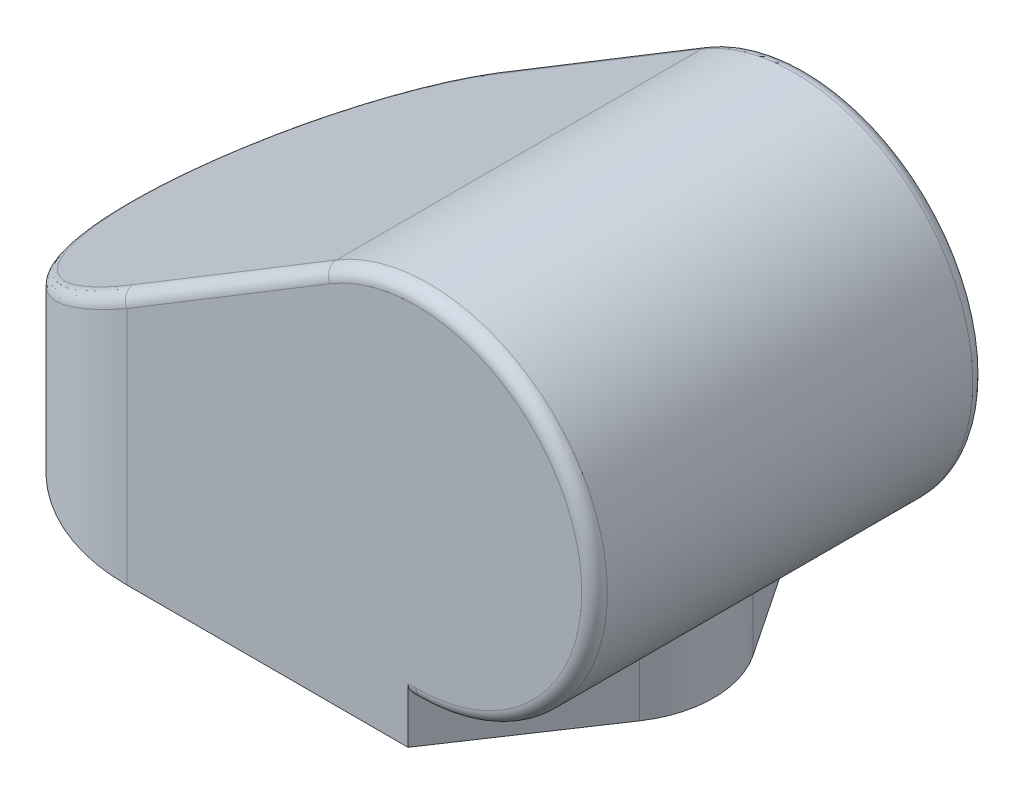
ISO-10303-21;
HEADER;
FILE_DESCRIPTION(('STEP AP214'),'2;1');
FILE_NAME('part.step','',(''),(''),'','','');
FILE_SCHEMA(('AUTOMOTIVE_DESIGN { 1 0 10303 214 1 1 1 1 }'));
ENDSEC;
DATA;
#1=APPLICATION_CONTEXT('core data for automotive mechanical design processes');
#2=APPLICATION_PROTOCOL_DEFINITION('international standard','automotive_design',2000,#1);
#3=PRODUCT_CONTEXT('',#1,'mechanical');
#4=PRODUCT('Part','Part','',(#3));
#5=PRODUCT_RELATED_PRODUCT_CATEGORY('part','',(#4));
#6=PRODUCT_DEFINITION_FORMATION('','',#4);
#7=PRODUCT_DEFINITION_CONTEXT('part definition',#1,'design');
#8=PRODUCT_DEFINITION('design','',#6,#7);
#9=PRODUCT_DEFINITION_SHAPE('','',#8);
#10=(LENGTH_UNIT() NAMED_UNIT(*) SI_UNIT(.MILLI.,.METRE.));
#11=(NAMED_UNIT(*) PLANE_ANGLE_UNIT() SI_UNIT($,.RADIAN.));
#12=(NAMED_UNIT(*) SI_UNIT($,.STERADIAN.) SOLID_ANGLE_UNIT());
#13=UNCERTAINTY_MEASURE_WITH_UNIT(LENGTH_MEASURE(1.E-05),#10,'distance_accuracy_value','');
#14=(GEOMETRIC_REPRESENTATION_CONTEXT(3) GLOBAL_UNCERTAINTY_ASSIGNED_CONTEXT((#13)) GLOBAL_UNIT_ASSIGNED_CONTEXT((#10,
#11,#12)) REPRESENTATION_CONTEXT('',''));
#15=CARTESIAN_POINT('',(0.,0.,0.));
#16=DIRECTION('',(0.,0.,1.));
#17=DIRECTION('',(1.,0.,0.));
#18=AXIS2_PLACEMENT_3D('',#15,#16,#17);
#19=CARTESIAN_POINT('',(0.,0.,0.));
#20=DIRECTION('',(0.,0.,1.));
#21=DIRECTION('',(1.,0.,0.));
#22=AXIS2_PLACEMENT_3D('',#19,#20,#21);
#23=CYLINDRICAL_SURFACE('',#22,0.0127);
#24=CARTESIAN_POINT('',(0.,0.,-18.2499));
#25=DIRECTION('',(0.,0.,1.));
#26=DIRECTION('',(1.,0.,0.));
#27=AXIS2_PLACEMENT_3D('',#24,#25,#26);
#28=CIRCLE('',#27,0.0127);
#29=CARTESIAN_POINT('',(0.0127,0.,-18.2499));
#30=VERTEX_POINT('',#29);
#31=EDGE_CURVE('E232',#30,#30,#28,.F.);
#32=ORIENTED_EDGE('',*,*,#31,.T.);
#33=EDGE_LOOP('',(#32));
#34=FACE_BOUND('',#33,.T.);
#35=CARTESIAN_POINT('',(0.,0.,18.2499));
#36=DIRECTION('',(0.,0.,1.));
#37=DIRECTION('',(1.,0.,0.));
#38=AXIS2_PLACEMENT_3D('',#35,#36,#37);
#39=CIRCLE('',#38,0.0127);
#40=CARTESIAN_POINT('',(0.0127,0.,18.2499));
#41=VERTEX_POINT('',#40);
#42=EDGE_CURVE('E23',#41,#41,#39,.F.);
#43=ORIENTED_EDGE('',*,*,#42,.F.);
#44=EDGE_LOOP('',(#43));
#45=FACE_BOUND('',#44,.T.);
#46=ADVANCED_FACE('F16',(#34,#45),#23,.F.);
#47=CARTESIAN_POINT('',(-27.0002,-10.2380976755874,0.));
#48=DIRECTION('',(0.,1.,0.));
#49=DIRECTION('',(0.,0.,1.));
#50=AXIS2_PLACEMENT_3D('',#47,#48,#49);
#51=CYLINDRICAL_SURFACE('',#50,18.2499);
#52=DIRECTION('',(0.,1.,0.));
#53=VECTOR('',#52,1.);
#54=CARTESIAN_POINT('',(-27.0002,-3.81379535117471,-18.2499));
#55=LINE('',#54,#53);
#56=CARTESIAN_POINT('',(-27.0002,1.73219158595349,-18.2499));
#57=VERTEX_POINT('',#56);
#58=CARTESIAN_POINT('',(-27.0002,-20.6248,-18.2499));
#59=VERTEX_POINT('',#58);
#60=EDGE_CURVE('E106',#57,#59,#55,.F.);
#61=ORIENTED_EDGE('',*,*,#60,.T.);
#62=CARTESIAN_POINT('',(-27.0002,-20.6248,0.));
#63=DIRECTION('',(0.,1.,0.));
#64=DIRECTION('',(0.,0.,1.));
#65=AXIS2_PLACEMENT_3D('',#62,#63,#64);
#66=CIRCLE('',#65,18.2499);
#67=CARTESIAN_POINT('',(-27.0002,-20.6248,18.2499));
#68=VERTEX_POINT('',#67);
#69=EDGE_CURVE('E108',#59,#68,#66,.T.);
#70=ORIENTED_EDGE('',*,*,#69,.T.);
#71=DIRECTION('',(0.,1.,0.));
#72=VECTOR('',#71,1.);
#73=CARTESIAN_POINT('',(-27.0002,-3.81379535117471,18.2499));
#74=LINE('',#73,#72);
#75=CARTESIAN_POINT('',(-27.0002,1.73219158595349,18.2499));
#76=VERTEX_POINT('',#75);
#77=EDGE_CURVE('E111',#76,#68,#74,.F.);
#78=ORIENTED_EDGE('',*,*,#77,.F.);
#79=CARTESIAN_POINT('',(-27.0002,1.73219158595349,-18.2499));
#80=CARTESIAN_POINT('',(-27.3676686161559,1.52420000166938,-18.2498873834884));
#81=CARTESIAN_POINT('',(-27.7351361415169,1.31620826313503,-18.2387558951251));
#82=CARTESIAN_POINT('',(-28.4687288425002,0.900983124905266,-18.1943283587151));
#83=CARTESIAN_POINT('',(-28.8348549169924,0.693749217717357,-18.1610518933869));
#84=CARTESIAN_POINT('',(-29.5644365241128,0.280791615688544,-18.0724851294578));
#85=CARTESIAN_POINT('',(-29.9278956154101,0.075065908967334,-18.0172335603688));
#86=CARTESIAN_POINT('',(-30.6508096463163,-0.334120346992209,-17.8848244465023));
#87=CARTESIAN_POINT('',(-31.0102725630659,-0.537585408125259,-17.8077244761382));
#88=CARTESIAN_POINT('',(-31.7238694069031,-0.941500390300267,-17.6318266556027));
#89=CARTESIAN_POINT('',(-32.0780173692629,-1.14195825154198,-17.533104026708));
#90=CARTESIAN_POINT('',(-32.7797051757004,-1.53913472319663,-17.3144141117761));
#91=CARTESIAN_POINT('',(-33.1272666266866,-1.7358655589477,-17.1945384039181));
#92=CARTESIAN_POINT('',(-33.8145004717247,-2.12486284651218,-16.9339682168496));
#93=CARTESIAN_POINT('',(-34.1542037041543,-2.31714674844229,-16.7933812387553));
#94=CARTESIAN_POINT('',(-34.8244252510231,-2.69651659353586,-16.4917835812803));
#95=CARTESIAN_POINT('',(-35.154985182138,-2.88362608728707,-16.3308951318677));
#96=CARTESIAN_POINT('',(-35.8057162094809,-3.25196558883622,-15.9892859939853));
#97=CARTESIAN_POINT('',(-36.1259400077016,-3.43322542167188,-15.8086979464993));
#98=CARTESIAN_POINT('',(-36.7548751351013,-3.78922952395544,-15.4284235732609));
#99=CARTESIAN_POINT('',(-37.0636505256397,-3.96401004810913,-15.2288772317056));
#100=CARTESIAN_POINT('',(-37.6685585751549,-4.30641571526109,-14.8113892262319));
#101=CARTESIAN_POINT('',(-37.9647675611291,-4.47408405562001,-14.5935937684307));
#102=CARTESIAN_POINT('',(-38.5433909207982,-4.80161331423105,-14.1403100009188));
#103=CARTESIAN_POINT('',(-38.82589447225,-4.96152470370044,-13.9049720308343));
#104=CARTESIAN_POINT('',(-39.3761194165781,-5.27298105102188,-13.4175030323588));
#105=CARTESIAN_POINT('',(-39.6439417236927,-5.42458312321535,-13.1655228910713));
#106=CARTESIAN_POINT('',(-40.0346166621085,-5.64572732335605,-12.7749095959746));
#107=CARTESIAN_POINT('',(-40.1626201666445,-5.71818471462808,-12.6430245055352));
#108=CARTESIAN_POINT('',(-40.4145733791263,-5.86080510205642,-12.3754334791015));
#109=CARTESIAN_POINT('',(-40.538537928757,-5.93097649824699,-12.2397460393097));
#110=CARTESIAN_POINT('',(-40.7822852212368,-6.06895243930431,-11.9646752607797));
#111=CARTESIAN_POINT('',(-40.9020835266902,-6.13676579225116,-11.8253101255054));
#112=CARTESIAN_POINT('',(-41.1373746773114,-6.2699556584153,-11.54299939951));
#113=CARTESIAN_POINT('',(-41.2528837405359,-6.33534135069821,-11.4000716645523));
#114=CARTESIAN_POINT('',(-41.4794833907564,-6.4636119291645,-11.1107606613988));
#115=CARTESIAN_POINT('',(-41.590590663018,-6.52650625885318,-10.9643946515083));
#116=CARTESIAN_POINT('',(-41.8083069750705,-6.64974897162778,-10.6683539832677));
#117=CARTESIAN_POINT('',(-41.9149328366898,-6.71010687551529,-10.5186956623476));
#118=CARTESIAN_POINT('',(-42.1236030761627,-6.82822961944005,-10.2162123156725));
#119=CARTESIAN_POINT('',(-42.2256643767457,-6.88600403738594,-10.0634027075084));
#120=CARTESIAN_POINT('',(-42.4251233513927,-6.9989133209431,-9.75475987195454));
#121=CARTESIAN_POINT('',(-42.5225379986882,-7.05405779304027,-9.59894113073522));
#122=CARTESIAN_POINT('',(-42.7126213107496,-7.16166057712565,-9.28442283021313));
#123=CARTESIAN_POINT('',(-42.8053069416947,-7.21412849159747,-9.12573681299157));
#124=CARTESIAN_POINT('',(-42.9858498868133,-7.31633156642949,-8.80562679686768));
#125=CARTESIAN_POINT('',(-43.0737240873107,-7.36607628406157,-8.64421537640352));
#126=CARTESIAN_POINT('',(-43.2445623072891,-7.46278663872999,-8.31879760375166));
#127=CARTESIAN_POINT('',(-43.3275430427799,-7.50976173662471,-8.15480284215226));
#128=CARTESIAN_POINT('',(-43.4885106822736,-7.6008855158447,-7.8243613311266));
#129=CARTESIAN_POINT('',(-43.5665140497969,-7.64504351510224,-7.65792517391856));
#130=CARTESIAN_POINT('',(-43.7174577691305,-7.73049395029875,-7.32275835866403));
#131=CARTESIAN_POINT('',(-43.7904142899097,-7.7717955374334,-7.15403731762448));
#132=CARTESIAN_POINT('',(-43.9311968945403,-7.85149500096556,-6.81446092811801));
#133=CARTESIAN_POINT('',(-43.9990388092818,-7.88990183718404,-6.64361424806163));
#134=CARTESIAN_POINT('',(-44.1295241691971,-7.96377330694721,-6.29994640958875));
#135=CARTESIAN_POINT('',(-44.1921830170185,-7.99924665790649,-6.12713297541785));
#136=CARTESIAN_POINT('',(-44.3122346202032,-8.06721289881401,-5.77969159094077));
#137=CARTESIAN_POINT('',(-44.3696422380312,-8.09971420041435,-5.60507042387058));
#138=CARTESIAN_POINT('',(-44.4791232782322,-8.16169781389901,-5.25417334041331));
#139=CARTESIAN_POINT('',(-44.5312108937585,-8.19118815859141,-5.07790327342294));
#140=CARTESIAN_POINT('',(-44.6299859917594,-8.24711255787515,-4.72386876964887));
#141=CARTESIAN_POINT('',(-44.6766868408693,-8.27355417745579,-4.54610925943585));
#142=CARTESIAN_POINT('',(-44.7646151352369,-8.32333967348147,-4.18925378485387));
#143=CARTESIAN_POINT('',(-44.805854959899,-8.34669055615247,-4.01016185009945));
#144=CARTESIAN_POINT('',(-44.8828220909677,-8.3902724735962,-3.650805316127));
#145=CARTESIAN_POINT('',(-44.9185603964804,-8.41050973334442,-3.47054382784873));
#146=CARTESIAN_POINT('',(-44.9845327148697,-8.44786903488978,-3.10901815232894));
#147=CARTESIAN_POINT('',(-45.014776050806,-8.46499635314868,-2.92775621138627));
#148=CARTESIAN_POINT('',(-45.0697579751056,-8.49613570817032,-2.56439621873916));
#149=CARTESIAN_POINT('',(-45.094504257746,-8.51015209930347,-2.38229970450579));
#150=CARTESIAN_POINT('',(-45.1384939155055,-8.5350700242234,-2.01743788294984));
#151=CARTESIAN_POINT('',(-45.1577433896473,-8.5459750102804,-1.83467354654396));
#152=CARTESIAN_POINT('',(-45.1907405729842,-8.56467318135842,-1.46864256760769));
#153=CARTESIAN_POINT('',(-45.2044928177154,-8.57246893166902,-1.28537646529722));
#154=CARTESIAN_POINT('',(-45.226496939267,-8.58494055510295,-0.918510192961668));
#155=CARTESIAN_POINT('',(-45.2347518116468,-8.5896181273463,-0.734910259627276));
#156=CARTESIAN_POINT('',(-45.2457620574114,-8.5958870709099,-0.367537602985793));
#157=CARTESIAN_POINT('',(-45.2485189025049,-8.5974792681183,-0.183764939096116));
#158=CARTESIAN_POINT('',(-45.2485341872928,-8.59745734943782,0.151515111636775));
#159=CARTESIAN_POINT('',(-45.2466726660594,-8.5963568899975,0.303024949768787));
#160=CARTESIAN_POINT('',(-45.2350284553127,-8.58960855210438,0.775766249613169));
#161=CARTESIAN_POINT('',(-45.2187047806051,-8.58024555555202,1.09683407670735));
#162=CARTESIAN_POINT('',(-45.1836006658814,-8.56019542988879,1.55183749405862));
#163=CARTESIAN_POINT('',(-45.1717098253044,-8.55341085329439,1.68653277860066));
#164=CARTESIAN_POINT('',(-45.143311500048,-8.53722014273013,1.97214151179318));
#165=CARTESIAN_POINT('',(-45.1264153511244,-8.52759379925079,2.12300480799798));
#166=CARTESIAN_POINT('',(-45.0868227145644,-8.50505111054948,2.44072805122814));
#167=CARTESIAN_POINT('',(-45.0636919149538,-8.49188893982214,2.60751622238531));
#168=CARTESIAN_POINT('',(-45.0103110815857,-8.46152054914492,2.95680358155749));
#169=CARTESIAN_POINT('',(-44.9795804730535,-8.44404156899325,3.13920627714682));
#170=CARTESIAN_POINT('',(-44.9292773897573,-8.41545878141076,3.41224330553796));
#171=CARTESIAN_POINT('',(-44.9117603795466,-8.40550983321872,3.50338373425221));
#172=CARTESIAN_POINT('',(-44.873104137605,-8.38357391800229,3.69648401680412));
#173=CARTESIAN_POINT('',(-44.8517843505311,-8.3714867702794,3.79839642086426));
#174=CARTESIAN_POINT('',(-44.7871842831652,-8.33487974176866,4.09436466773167));
#175=CARTESIAN_POINT('',(-44.7415955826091,-8.30906720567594,4.28776260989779));
#176=CARTESIAN_POINT('',(-44.6363331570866,-8.24949691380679,4.70349844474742));
#177=CARTESIAN_POINT('',(-44.5755736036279,-8.21512916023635,4.92547402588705));
#178=CARTESIAN_POINT('',(-44.4367743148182,-8.13664042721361,5.39720797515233));
#179=CARTESIAN_POINT('',(-44.3575061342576,-8.09182755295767,5.64648987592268));
#180=CARTESIAN_POINT('',(-44.1781177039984,-7.99043330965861,6.17127571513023));
#181=CARTESIAN_POINT('',(-44.0766296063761,-7.93308113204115,6.44616568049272));
#182=CARTESIAN_POINT('',(-43.9159824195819,-7.84229490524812,6.85119569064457));
#183=CARTESIAN_POINT('',(-43.8615518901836,-7.81153430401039,6.98383811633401));
#184=CARTESIAN_POINT('',(-43.7496006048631,-7.74825729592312,7.24780935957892));
#185=CARTESIAN_POINT('',(-43.6920722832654,-7.71573658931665,7.3791339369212));
#186=CARTESIAN_POINT('',(-43.5146642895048,-7.61543776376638,7.77156634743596));
#187=CARTESIAN_POINT('',(-43.3903826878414,-7.54516090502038,8.03007216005));
#188=CARTESIAN_POINT('',(-43.1735631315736,-7.42253409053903,8.45542246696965));
#189=CARTESIAN_POINT('',(-43.0840922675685,-7.37192606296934,8.62435099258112));
#190=CARTESIAN_POINT('',(-42.8999437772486,-7.26775344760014,8.95934777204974));
#191=CARTESIAN_POINT('',(-42.8052471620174,-7.21417807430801,9.12540226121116));
#192=CARTESIAN_POINT('',(-42.6107386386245,-7.10412213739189,9.45447948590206));
#193=CARTESIAN_POINT('',(-42.5109076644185,-7.04763074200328,9.61748731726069));
#194=CARTESIAN_POINT('',(-42.3062175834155,-6.93179171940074,9.94030945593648));
#195=CARTESIAN_POINT('',(-42.2013393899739,-6.87243324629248,10.100107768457));
#196=CARTESIAN_POINT('',(-41.9866427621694,-6.75090945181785,10.4163461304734));
#197=CARTESIAN_POINT('',(-41.876805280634,-6.68873330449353,10.5727690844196));
#198=CARTESIAN_POINT('',(-41.6522791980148,-6.5616239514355,10.8820943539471));
#199=CARTESIAN_POINT('',(-41.5375716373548,-6.49667996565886,11.0349784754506));
#200=CARTESIAN_POINT('',(-41.3033890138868,-6.36408256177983,11.3370571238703));
#201=CARTESIAN_POINT('',(-41.1838950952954,-6.2964184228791,11.4862323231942));
#202=CARTESIAN_POINT('',(-40.9402597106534,-6.15844517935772,11.7807483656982));
#203=CARTESIAN_POINT('',(-40.8160998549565,-6.08812560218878,11.9260690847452));
#204=CARTESIAN_POINT('',(-40.5632756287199,-5.94493287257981,12.2127517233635));
#205=CARTESIAN_POINT('',(-40.4345936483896,-5.87204973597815,12.3540931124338));
#206=CARTESIAN_POINT('',(-40.1728713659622,-5.72377086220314,12.6326791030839));
#207=CARTESIAN_POINT('',(-40.0398143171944,-5.64836544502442,12.7699028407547));
#208=CARTESIAN_POINT('',(-39.8452165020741,-5.53816420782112,12.9644205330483));
#209=CARTESIAN_POINT('',(-39.7851442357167,-5.50415588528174,13.0236406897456));
#210=CARTESIAN_POINT('',(-39.5862696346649,-5.39157379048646,13.2170032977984));
#211=CARTESIAN_POINT('',(-39.4459801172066,-5.3121651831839,13.34913661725));
#212=CARTESIAN_POINT('',(-39.0808465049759,-5.10548946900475,13.6823545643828));
#213=CARTESIAN_POINT('',(-38.8534403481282,-4.97677343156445,13.8797528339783));
#214=CARTESIAN_POINT('',(-38.4744081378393,-4.76223730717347,14.1927706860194));
#215=CARTESIAN_POINT('',(-38.3251162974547,-4.67773733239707,14.312149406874));
#216=CARTESIAN_POINT('',(-38.0013646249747,-4.49449294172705,14.562826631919));
#217=CARTESIAN_POINT('',(-37.8264236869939,-4.39547633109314,14.6933069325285));
#218=CARTESIAN_POINT('',(-37.449914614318,-4.18237293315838,14.9638243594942));
#219=CARTESIAN_POINT('',(-37.2478305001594,-4.06799420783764,15.1029129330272));
#220=CARTESIAN_POINT('',(-36.8155363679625,-3.82331839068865,15.3878754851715));
#221=CARTESIAN_POINT('',(-36.5847836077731,-3.69271419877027,15.5326641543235));
#222=CARTESIAN_POINT('',(-36.1604800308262,-3.45256241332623,15.7859335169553));
#223=CARTESIAN_POINT('',(-35.9677531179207,-3.34348103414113,15.8962433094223));
#224=CARTESIAN_POINT('',(-35.5650022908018,-3.1155289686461,16.1171425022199));
#225=CARTESIAN_POINT('',(-35.354742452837,-2.99652479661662,16.2271648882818));
#226=CARTESIAN_POINT('',(-34.9163981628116,-2.74842766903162,16.4457471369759));
#227=CARTESIAN_POINT('',(-34.6880804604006,-2.61920267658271,16.5536888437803));
#228=CARTESIAN_POINT('',(-34.2131842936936,-2.35042083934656,16.766272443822));
#229=CARTESIAN_POINT('',(-33.9663796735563,-2.2107362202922,16.8702496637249));
#230=CARTESIAN_POINT('',(-33.6102144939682,-2.00914818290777,17.0111989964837));
#231=CARTESIAN_POINT('',(-33.5022091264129,-1.94801649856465,17.0527565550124));
#232=CARTESIAN_POINT('',(-33.1399883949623,-1.74299699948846,17.1882004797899));
#233=CARTESIAN_POINT('',(-32.8844122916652,-1.59833846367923,17.2773286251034));
#234=CARTESIAN_POINT('',(-32.3147768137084,-1.27591909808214,17.4619523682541));
#235=CARTESIAN_POINT('',(-32.0000287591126,-1.09776842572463,17.5546528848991));
#236=CARTESIAN_POINT('',(-31.4889259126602,-0.808478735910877,17.6903770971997));
#237=CARTESIAN_POINT('',(-31.2936397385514,-0.697944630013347,17.7387864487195));
#238=CARTESIAN_POINT('',(-30.8773797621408,-0.46233689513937,17.8346859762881));
#239=CARTESIAN_POINT('',(-30.6562524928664,-0.337176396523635,17.8813014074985));
#240=CARTESIAN_POINT('',(-30.1880474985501,-0.0721671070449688,17.9709695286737));
#241=CARTESIAN_POINT('',(-29.9408278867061,0.0677619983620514,18.01304395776));
#242=CARTESIAN_POINT('',(-29.4203277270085,0.362371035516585,18.0906664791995));
#243=CARTESIAN_POINT('',(-29.1469248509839,0.517120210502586,18.1251338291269));
#244=CARTESIAN_POINT('',(-28.5741710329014,0.84130550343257,18.1842477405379));
#245=CARTESIAN_POINT('',(-28.2747274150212,1.01079408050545,18.2077121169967));
#246=CARTESIAN_POINT('',(-27.6502919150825,1.36423188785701,18.2411758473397));
#247=CARTESIAN_POINT('',(-27.325247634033,1.5482107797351,18.2498922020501));
#248=CARTESIAN_POINT('',(-27.0002,1.73219158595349,18.2499));
#249=B_SPLINE_CURVE_WITH_KNOTS('',3,(#79,#80,#81,#82,#83,#84,#85,#86,#87,#88,#89,#90,#91,#92,
#93,#94,#95,#96,#97,#98,#99,#100,#101,#102,#103,#104,#105,#106,#107,#108,#109,#110,#111,#112,
#113,#114,#115,#116,#117,#118,#119,#120,#121,#122,#123,#124,#125,#126,#127,#128,#129,#130,#131,
#132,#133,#134,#135,#136,#137,#138,#139,#140,#141,#142,#143,#144,#145,#146,#147,#148,#149,#150,
#151,#152,#153,#154,#155,#156,#157,#158,#159,#160,#161,#162,#163,#164,#165,#166,#167,#168,#169,
#170,#171,#172,#173,#174,#175,#176,#177,#178,#179,#180,#181,#182,#183,#184,#185,#186,#187,#188,
#189,#190,#191,#192,#193,#194,#195,#196,#197,#198,#199,#200,#201,#202,#203,#204,#205,#206,#207,
#208,#209,#210,#211,#212,#213,#214,#215,#216,#217,#218,#219,#220,#221,#222,#223,#224,#225,#226,
#227,#228,#229,#230,#231,#232,#233,#234,#235,#236,#237,#238,#239,#240,#241,#242,#243,#244,#245,
#246,#247,#248),.UNSPECIFIED.,.F.,.F.,(4,2,2,2,2,2,2,2,2,2,2,2,2,2,2,2,2,2,2,2,2,2,2,2,2,2,2,2,
2,2,2,2,2,2,2,2,2,2,2,2,2,2,2,2,2,2,2,2,2,2,2,2,2,2,2,2,2,2,2,2,2,2,2,2,2,2,2,2,2,2,2,2,2,2,2,2,
2,2,2,2,2,2,2,2,4),(0.,1.26659827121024,2.53207798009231,3.79533718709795,5.05529795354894,
6.31094326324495,7.56128021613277,8.80534218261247,10.0422425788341,11.2712762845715,
12.4918519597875,13.7034437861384,14.9056378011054,16.0981277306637,16.6907241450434,
17.280816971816,17.8683964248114,18.4534636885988,19.0360455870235,19.6161987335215,
20.1939840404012,20.769465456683,21.3427113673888,21.9137960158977,22.4828009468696,
23.0498141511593,23.6149174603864,24.1781929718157,24.7397294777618,25.2996240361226,
25.8579835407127,26.4149262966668,26.9705840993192,27.5251161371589,28.0786983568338,
28.6315007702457,29.1836874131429,29.7354175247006,30.2868467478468,30.8381283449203,
31.292662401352,32.2568042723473,32.6629442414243,33.1192112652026,33.6258253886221,
34.1830926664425,34.4631017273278,34.7775368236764,35.3784939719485,36.0763595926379,
36.8722368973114,37.7675260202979,38.2074010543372,38.6484039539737,39.5339030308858,
40.1270425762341,40.7225010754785,41.3203578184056,41.9206870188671,42.5235595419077,
43.1290445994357,43.7372098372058,44.3480940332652,44.9617008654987,45.5780192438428,
45.8508695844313,46.4760841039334,47.4581180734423,48.0850274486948,48.8038419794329,
49.6156828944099,50.5217241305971,51.263815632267,52.0600603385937,52.9109305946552,
53.8168187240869,54.2094437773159,55.1298972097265,56.249514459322,56.9381107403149,
57.7129639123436,58.5742953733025,59.5221839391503,60.5565110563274,61.6769110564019),.UNSPECIFIED.);
#250=EDGE_CURVE('E323',#57,#76,#249,.T.);
#251=ORIENTED_EDGE('',*,*,#250,.F.);
#252=EDGE_LOOP('',(#61,#70,#78,#251));
#253=FACE_BOUND('',#252,.T.);
#254=ADVANCED_FACE('F110',(#253),#51,.T.);
#255=CARTESIAN_POINT('',(-6.74272155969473,-15.4686,17.0561));
#256=DIRECTION('',(-1.,0.,0.));
#257=DIRECTION('',(0.,-1.,0.));
#258=AXIS2_PLACEMENT_3D('',#255,#256,#257);
#259=CYLINDRICAL_SURFACE('',#258,1.1938);
#260=CARTESIAN_POINT('',(0.,-15.4686,17.0561));
#261=DIRECTION('',(-1.,0.,0.));
#262=DIRECTION('',(0.,-1.,0.));
#263=AXIS2_PLACEMENT_3D('',#260,#261,#262);
#264=CIRCLE('',#263,1.1938);
#265=CARTESIAN_POINT('',(0.,-15.4686,18.2499));
#266=VERTEX_POINT('',#265);
#267=CARTESIAN_POINT('',(0.,-16.6605691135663,17.1221913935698));
#268=VERTEX_POINT('',#267);
#269=EDGE_CURVE('E353',#266,#268,#264,.F.);
#270=ORIENTED_EDGE('',*,*,#269,.F.);
#271=DIRECTION('',(1.,0.,0.));
#272=VECTOR('',#271,1.);
#273=CARTESIAN_POINT('',(-13.4854431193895,-15.4686,18.2499));
#274=LINE('',#273,#272);
#275=CARTESIAN_POINT('',(-0.754935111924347,-15.4686,18.2499));
#276=VERTEX_POINT('',#275);
#277=EDGE_CURVE('E125',#276,#266,#274,.T.);
#278=ORIENTED_EDGE('',*,*,#277,.F.);
#279=CARTESIAN_POINT('',(0.0442443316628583,-15.4686,17.0561));
#280=DIRECTION('',(0.830984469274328,0.,0.556295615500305));
#281=DIRECTION('',(-0.556295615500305,0.,0.830984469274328));
#282=AXIS2_PLACEMENT_3D('',#279,#280,#281);
#283=ELLIPSE('',#282,1.43660927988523,1.1938);
#284=EDGE_CURVE('E290',#268,#276,#283,.F.);
#285=ORIENTED_EDGE('',*,*,#284,.F.);
#286=EDGE_LOOP('',(#270,#278,#285));
#287=FACE_BOUND('',#286,.T.);
#288=ADVANCED_FACE('F162',(#287),#259,.T.);
#289=CARTESIAN_POINT('',(-13.4854431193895,-3.81379535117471,18.2499));
#290=DIRECTION('',(0.,0.,1.));
#291=DIRECTION('',(1.,0.,0.));
#292=AXIS2_PLACEMENT_3D('',#289,#290,#291);
#293=PLANE('',#292);
#294=ORIENTED_EDGE('',*,*,#42,.T.);
#295=EDGE_LOOP('',(#294));
#296=FACE_BOUND('',#295,.T.);
#297=DIRECTION('',(1.,0.,0.));
#298=VECTOR('',#297,1.);
#299=CARTESIAN_POINT('',(-17.5106487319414,-20.6248,18.2499));
#300=LINE('',#299,#298);
#301=CARTESIAN_POINT('',(-0.754935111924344,-20.6248,18.2499));
#302=VERTEX_POINT('',#301);
#303=EDGE_CURVE('E116',#68,#302,#300,.T.);
#304=ORIENTED_EDGE('',*,*,#303,.T.);
#305=DIRECTION('',(0.,1.,0.));
#306=VECTOR('',#305,1.);
#307=CARTESIAN_POINT('',(-0.754935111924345,-20.6248,18.2499));
#308=LINE('',#307,#306);
#309=EDGE_CURVE('E142',#276,#302,#308,.F.);
#310=ORIENTED_EDGE('',*,*,#309,.F.);
#311=ORIENTED_EDGE('',*,*,#277,.T.);
#312=CARTESIAN_POINT('',(0.,0.,18.2499));
#313=DIRECTION('',(0.,0.,-1.));
#314=DIRECTION('',(-0.518031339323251,0.855361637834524,0.));
#315=AXIS2_PLACEMENT_3D('',#312,#313,#314);
#316=CIRCLE('',#315,15.4686);
#317=CARTESIAN_POINT('',(-8.01321957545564,13.2312470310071,18.2499));
#318=VERTEX_POINT('',#317);
#319=EDGE_CURVE('E147',#318,#266,#316,.T.);
#320=ORIENTED_EDGE('',*,*,#319,.F.);
#321=DIRECTION('',(0.855361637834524,0.518031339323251,0.));
#322=VECTOR('',#321,1.);
#323=CARTESIAN_POINT('',(-32.1006697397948,-1.3567979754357,18.2499));
#324=LINE('',#323,#322);
#325=EDGE_CURVE('E123',#76,#318,#324,.T.);
#326=ORIENTED_EDGE('',*,*,#325,.F.);
#327=ORIENTED_EDGE('',*,*,#77,.T.);
#328=EDGE_LOOP('',(#304,#310,#311,#320,#326,#327));
#329=FACE_BOUND('',#328,.T.);
#330=ADVANCED_FACE('F119',(#296,#329),#293,.T.);
#331=CARTESIAN_POINT('',(-17.5106487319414,-20.6248,0.));
#332=DIRECTION('',(0.,1.,0.));
#333=DIRECTION('',(0.,0.,1.));
#334=AXIS2_PLACEMENT_3D('',#331,#332,#333);
#335=PLANE('',#334);
#336=ORIENTED_EDGE('',*,*,#303,.F.);
#337=ORIENTED_EDGE('',*,*,#69,.F.);
#338=DIRECTION('',(1.,0.,0.));
#339=VECTOR('',#338,1.);
#340=CARTESIAN_POINT('',(-13.4854431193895,-20.6248,-18.2499));
#341=LINE('',#340,#339);
#342=CARTESIAN_POINT('',(-0.754935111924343,-20.6248,-18.2499));
#343=VERTEX_POINT('',#342);
#344=EDGE_CURVE('E132',#59,#343,#341,.T.);
#345=ORIENTED_EDGE('',*,*,#344,.T.);
#346=DIRECTION('',(-0.556295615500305,0.,-0.830984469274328));
#347=VECTOR('',#346,1.);
#348=CARTESIAN_POINT('',(-0.754935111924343,-20.6248,-18.2499));
#349=LINE('',#348,#347);
#350=CARTESIAN_POINT('',(7.91512706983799,-20.6248,-5.2987157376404));
#351=VERTEX_POINT('',#350);
#352=EDGE_CURVE('E279',#351,#343,#349,.T.);
#353=ORIENTED_EDGE('',*,*,#352,.F.);
#354=CARTESIAN_POINT('',(0.,-20.6248,0.));
#355=DIRECTION('',(0.,1.,0.));
#356=DIRECTION('',(-1.,0.,0.));
#357=AXIS2_PLACEMENT_3D('',#354,#355,#356);
#358=CIRCLE('',#357,9.525);
#359=CARTESIAN_POINT('',(7.91512706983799,-20.6248,5.29871573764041));
#360=VERTEX_POINT('',#359);
#361=EDGE_CURVE('E288',#360,#351,#358,.T.);
#362=ORIENTED_EDGE('',*,*,#361,.F.);
#363=DIRECTION('',(0.556295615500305,0.,-0.830984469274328));
#364=VECTOR('',#363,1.);
#365=CARTESIAN_POINT('',(7.915127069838,-20.6248,5.2987157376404));
#366=LINE('',#365,#364);
#367=EDGE_CURVE('E129',#302,#360,#366,.T.);
#368=ORIENTED_EDGE('',*,*,#367,.F.);
#369=EDGE_LOOP('',(#336,#337,#345,#353,#362,#368));
#370=FACE_BOUND('',#369,.T.);
#371=ADVANCED_FACE('F127',(#370),#335,.F.);
#372=CARTESIAN_POINT('',(-6.74272155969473,-15.4686,-17.0561));
#373=DIRECTION('',(1.,0.,0.));
#374=DIRECTION('',(0.,1.,0.));
#375=AXIS2_PLACEMENT_3D('',#372,#373,#374);
#376=CYLINDRICAL_SURFACE('',#375,1.1938);
#377=DIRECTION('',(1.,0.,0.));
#378=VECTOR('',#377,1.);
#379=CARTESIAN_POINT('',(-13.4854431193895,-15.4686,-18.2499));
#380=LINE('',#379,#378);
#381=CARTESIAN_POINT('',(-0.754935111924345,-15.4686,-18.2499));
#382=VERTEX_POINT('',#381);
#383=CARTESIAN_POINT('',(0.,-15.4686,-18.2499));
#384=VERTEX_POINT('',#383);
#385=EDGE_CURVE('E225',#382,#384,#380,.T.);
#386=ORIENTED_EDGE('',*,*,#385,.T.);
#387=CARTESIAN_POINT('',(0.,-15.4686,-17.0561));
#388=DIRECTION('',(1.,0.,0.));
#389=DIRECTION('',(0.,-1.,0.));
#390=AXIS2_PLACEMENT_3D('',#387,#388,#389);
#391=CIRCLE('',#390,1.1938);
#392=CARTESIAN_POINT('',(0.,-16.6605691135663,-17.1221913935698));
#393=VERTEX_POINT('',#392);
#394=EDGE_CURVE('E244',#393,#384,#391,.T.);
#395=ORIENTED_EDGE('',*,*,#394,.F.);
#396=CARTESIAN_POINT('',(0.0442443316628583,-15.4686,-17.0561));
#397=DIRECTION('',(0.830984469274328,0.,-0.556295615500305));
#398=DIRECTION('',(0.556295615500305,0.,0.830984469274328));
#399=AXIS2_PLACEMENT_3D('',#396,#397,#398);
#400=ELLIPSE('',#399,1.43660927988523,1.1938);
#401=EDGE_CURVE('E285',#382,#393,#400,.F.);
#402=ORIENTED_EDGE('',*,*,#401,.F.);
#403=EDGE_LOOP('',(#386,#395,#402));
#404=FACE_BOUND('',#403,.T.);
#405=ADVANCED_FACE('F216',(#404),#376,.T.);
#406=CARTESIAN_POINT('',(-13.4854431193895,-3.81379535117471,-18.2499));
#407=DIRECTION('',(0.,0.,1.));
#408=DIRECTION('',(1.,0.,0.));
#409=AXIS2_PLACEMENT_3D('',#406,#407,#408);
#410=PLANE('',#409);
#411=ORIENTED_EDGE('',*,*,#31,.F.);
#412=EDGE_LOOP('',(#411));
#413=FACE_BOUND('',#412,.T.);
#414=ORIENTED_EDGE('',*,*,#385,.F.);
#415=DIRECTION('',(0.,1.,0.));
#416=VECTOR('',#415,1.);
#417=CARTESIAN_POINT('',(-0.754935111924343,-20.6248,-18.2499));
#418=LINE('',#417,#416);
#419=EDGE_CURVE('E275',#343,#382,#418,.T.);
#420=ORIENTED_EDGE('',*,*,#419,.F.);
#421=ORIENTED_EDGE('',*,*,#344,.F.);
#422=ORIENTED_EDGE('',*,*,#60,.F.);
#423=DIRECTION('',(-0.855361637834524,-0.518031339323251,0.));
#424=VECTOR('',#423,1.);
#425=CARTESIAN_POINT('',(-32.1006697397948,-1.35679797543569,-18.2499));
#426=LINE('',#425,#424);
#427=CARTESIAN_POINT('',(-8.01321957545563,13.2312470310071,-18.2499));
#428=VERTEX_POINT('',#427);
#429=EDGE_CURVE('E319',#428,#57,#426,.T.);
#430=ORIENTED_EDGE('',*,*,#429,.F.);
#431=CARTESIAN_POINT('',(0.,0.,-18.2499));
#432=DIRECTION('',(0.,0.,1.));
#433=DIRECTION('',(0.,-1.,0.));
#434=AXIS2_PLACEMENT_3D('',#431,#432,#433);
#435=CIRCLE('',#434,15.4686);
#436=EDGE_CURVE('E239',#384,#428,#435,.T.);
#437=ORIENTED_EDGE('',*,*,#436,.F.);
#438=EDGE_LOOP('',(#414,#420,#421,#422,#430,#437));
#439=FACE_BOUND('',#438,.T.);
#440=ADVANCED_FACE('F210',(#413,#439),#410,.F.);
#441=CARTESIAN_POINT('',(-32.1006697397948,-1.35679797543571,-17.0561));
#442=DIRECTION('',(-0.855361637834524,-0.518031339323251,0.));
#443=DIRECTION('',(0.518031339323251,-0.855361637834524,0.));
#444=AXIS2_PLACEMENT_3D('',#441,#442,#443);
#445=CYLINDRICAL_SURFACE('',#444,1.1938);
#446=CARTESIAN_POINT('',(-27.6186258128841,2.75332230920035,-17.0371603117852));
#447=CARTESIAN_POINT('',(-27.6186258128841,2.75332230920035,-17.0434735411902));
#448=CARTESIAN_POINT('',(-27.6186258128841,2.75332230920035,-17.0497867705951));
#449=CARTESIAN_POINT('',(-27.6186258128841,2.75332230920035,-17.0561));
#450=CARTESIAN_POINT('',(-27.6186258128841,2.75332230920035,-17.2346920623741));
#451=CARTESIAN_POINT('',(-27.581555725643,2.69211301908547,-17.546897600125));
#452=CARTESIAN_POINT('',(-27.4322655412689,2.44560844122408,-17.953431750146));
#453=CARTESIAN_POINT('',(-27.2315735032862,2.11423028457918,-18.1970372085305));
#454=CARTESIAN_POINT('',(-27.0695872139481,1.84676218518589,-18.2499));
#455=CARTESIAN_POINT('',(-27.0002,1.73219158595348,-18.2499));
#456=CARTESIAN_POINT('',(-26.9969619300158,1.7268449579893,-18.2499));
#457=CARTESIAN_POINT('',(-26.9937238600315,1.72149833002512,-18.2499));
#458=CARTESIAN_POINT('',(-26.9904857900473,1.71615170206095,-18.2499));
#459=B_SPLINE_CURVE_WITH_KNOTS('',3,(#446,#447,#448,#449,#450,#451,#452,#453,#454,#455,#456,
#457,#458),.UNSPECIFIED.,.F.,.F.,(4,3,1,1,1,3,4),(-0.0101,0.,0.285714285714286,0.5,
0.785714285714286,1.,1.01),.UNSPECIFIED.);
#460=CARTESIAN_POINT('',(-27.6186258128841,2.75332230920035,-17.0561));
#461=VERTEX_POINT('',#460);
#462=EDGE_CURVE('E185',#461,#57,#459,.T.);
#463=ORIENTED_EDGE('',*,*,#462,.F.);
#464=DIRECTION('',(-0.855361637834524,-0.518031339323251,0.));
#465=VECTOR('',#464,1.);
#466=CARTESIAN_POINT('',(-45.2501,-7.9248,-17.0561));
#467=LINE('',#466,#465);
#468=CARTESIAN_POINT('',(-8.63164538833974,14.252377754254,-17.0561));
#469=VERTEX_POINT('',#468);
#470=EDGE_CURVE('E38',#469,#461,#467,.T.);
#471=ORIENTED_EDGE('',*,*,#470,.F.);
#472=CARTESIAN_POINT('',(-8.01321957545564,13.2312470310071,-17.0561));
#473=DIRECTION('',(-0.855361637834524,-0.518031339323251,0.));
#474=DIRECTION('',(-0.518031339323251,0.855361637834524,0.));
#475=AXIS2_PLACEMENT_3D('',#472,#473,#474);
#476=CIRCLE('',#475,1.1938);
#477=EDGE_CURVE('E269',#428,#469,#476,.F.);
#478=ORIENTED_EDGE('',*,*,#477,.F.);
#479=ORIENTED_EDGE('',*,*,#429,.T.);
#480=EDGE_LOOP('',(#463,#471,#478,#479));
#481=FACE_BOUND('',#480,.T.);
#482=ADVANCED_FACE('F200',(#481),#445,.T.);
#483=CARTESIAN_POINT('',(-27.6186258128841,2.75332230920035,17.0371603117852));
#484=CARTESIAN_POINT('',(-27.6186258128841,2.75332230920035,17.0434735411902));
#485=CARTESIAN_POINT('',(-27.6186258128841,2.75332230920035,17.0497867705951));
#486=CARTESIAN_POINT('',(-27.6186258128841,2.75332230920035,17.0561));
#487=CARTESIAN_POINT('',(-27.6186258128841,2.75332230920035,17.2346920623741));
#488=CARTESIAN_POINT('',(-27.581555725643,2.69211301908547,17.546897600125));
#489=CARTESIAN_POINT('',(-27.4322655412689,2.44560844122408,17.953431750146));
#490=CARTESIAN_POINT('',(-27.2315735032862,2.11423028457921,18.1970372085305));
#491=CARTESIAN_POINT('',(-27.0695872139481,1.8467621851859,18.2499));
#492=CARTESIAN_POINT('',(-27.0002,1.73219158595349,18.2499));
#493=CARTESIAN_POINT('',(-26.9969619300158,1.72684495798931,18.2499));
#494=CARTESIAN_POINT('',(-26.9937238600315,1.72149833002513,18.2499));
#495=CARTESIAN_POINT('',(-26.9904857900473,1.71615170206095,18.2499));
#496=CARTESIAN_POINT('',(-28.8933837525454,1.98129669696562,17.0376289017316));
#497=CARTESIAN_POINT('',(-28.8937288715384,1.9810863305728,17.0437859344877));
#498=CARTESIAN_POINT('',(-28.8940739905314,1.98087596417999,17.0499429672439));
#499=CARTESIAN_POINT('',(-28.8944191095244,1.98066559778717,17.0561));
#500=CARTESIAN_POINT('',(-28.9041820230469,1.9747146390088,17.2302734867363));
#501=CARTESIAN_POINT('',(-28.8860737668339,1.90626443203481,17.5348180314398));
#502=CARTESIAN_POINT('',(-28.7660175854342,1.65782799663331,17.9354106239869));
#503=CARTESIAN_POINT('',(-28.5869976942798,1.33213349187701,18.182345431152));
#504=CARTESIAN_POINT('',(-28.4329609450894,1.07129581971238,18.2447323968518));
#505=CARTESIAN_POINT('',(-28.3652893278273,0.959534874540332,18.2499));
#506=CARTESIAN_POINT('',(-28.3621313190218,0.954319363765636,18.2501411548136));
#507=CARTESIAN_POINT('',(-28.3589733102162,0.949103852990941,18.2503823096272));
#508=CARTESIAN_POINT('',(-28.3558153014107,0.943888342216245,18.2506234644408));
#509=CARTESIAN_POINT('',(-31.4428486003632,0.437265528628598,16.7511871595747));
#510=CARTESIAN_POINT('',(-31.4438335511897,0.436668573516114,16.7569559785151));
#511=CARTESIAN_POINT('',(-31.4448185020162,0.43607161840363,16.7627247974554));
#512=CARTESIAN_POINT('',(-31.4458034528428,0.435474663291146,16.7684936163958));
#513=CARTESIAN_POINT('',(-31.47366627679,0.418587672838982,16.9316850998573));
#514=CARTESIAN_POINT('',(-31.4907625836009,0.336864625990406,17.2170619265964));
#515=CARTESIAN_POINT('',(-31.4268045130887,0.0850809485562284,17.5998839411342));
#516=CARTESIAN_POINT('',(-31.2920332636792,-0.230195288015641,17.8485920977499));
#517=CARTESIAN_POINT('',(-31.1574659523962,-0.479039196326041,17.9273978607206));
#518=CARTESIAN_POINT('',(-31.0952515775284,-0.585656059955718,17.9421633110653));
#519=CARTESIAN_POINT('',(-31.0923482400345,-0.590631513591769,17.9428523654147));
#520=CARTESIAN_POINT('',(-31.0894449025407,-0.595606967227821,17.9435414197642));
#521=CARTESIAN_POINT('',(-31.0865415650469,-0.600582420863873,17.9442304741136));
#522=CARTESIAN_POINT('',(-35.0763685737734,-1.76329557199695,15.4817096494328));
#523=CARTESIAN_POINT('',(-35.0781541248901,-1.76437804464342,15.4867247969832));
#524=CARTESIAN_POINT('',(-35.0799396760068,-1.76546051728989,15.4917399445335));
#525=CARTESIAN_POINT('',(-35.0817252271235,-1.76654298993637,15.4967550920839));
#526=CARTESIAN_POINT('',(-35.132235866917,-1.79716456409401,15.6386263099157));
#527=CARTESIAN_POINT('',(-35.1937216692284,-1.89503485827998,15.8867892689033));
#528=CARTESIAN_POINT('',(-35.2043530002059,-2.15055483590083,16.2281038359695));
#529=CARTESIAN_POINT('',(-35.1343999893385,-2.45299449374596,16.4641731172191));
#530=CARTESIAN_POINT('',(-35.0354447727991,-2.68727504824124,16.5566910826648));
#531=CARTESIAN_POINT('',(-34.9856608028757,-2.78767371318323,16.5814125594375));
#532=CARTESIAN_POINT('',(-34.9833375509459,-2.79235898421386,16.5825662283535));
#533=CARTESIAN_POINT('',(-34.9810142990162,-2.79704425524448,16.5837198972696));
#534=CARTESIAN_POINT('',(-34.9786910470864,-2.80172952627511,16.5848735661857));
#535=CARTESIAN_POINT('',(-38.3346916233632,-3.73663202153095,13.4347734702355));
#536=CARTESIAN_POINT('',(-38.3371226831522,-3.73810432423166,13.4389116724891));
#537=CARTESIAN_POINT('',(-38.3395537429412,-3.73957662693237,13.4430498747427));
#538=CARTESIAN_POINT('',(-38.3419848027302,-3.74104892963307,13.4471880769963));
#539=CARTESIAN_POINT('',(-38.4107559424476,-3.78269822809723,13.5642517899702));
#540=CARTESIAN_POINT('',(-38.5081823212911,-3.89331272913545,13.7690300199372));
#541=CARTESIAN_POINT('',(-38.5820318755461,-4.15152950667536,14.0565923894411));
#542=CARTESIAN_POINT('',(-38.5711842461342,-4.44377541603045,14.2654592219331));
#543=CARTESIAN_POINT('',(-38.5095026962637,-4.66667141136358,14.3591973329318));
#544=CARTESIAN_POINT('',(-38.4741142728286,-4.76217965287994,14.3883911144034));
#545=CARTESIAN_POINT('',(-38.4724628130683,-4.7666367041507,14.3897534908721));
#546=CARTESIAN_POINT('',(-38.470811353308,-4.77109375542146,14.3911158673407));
#547=CARTESIAN_POINT('',(-38.4691598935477,-4.77555080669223,14.3924782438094));
#548=CARTESIAN_POINT('',(-41.5123703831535,-5.66112211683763,10.2614836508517));
#549=CARTESIAN_POINT('',(-41.5153778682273,-5.66294437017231,10.2644946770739));
#550=CARTESIAN_POINT('',(-41.5183853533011,-5.66476662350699,10.267505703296));
#551=CARTESIAN_POINT('',(-41.5213928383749,-5.66658887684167,10.2705167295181));
#552=CARTESIAN_POINT('',(-41.6064702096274,-5.71813776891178,10.3556942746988));
#553=CARTESIAN_POINT('',(-41.7361934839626,-5.83988405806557,10.5047313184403));
#554=CARTESIAN_POINT('',(-41.8689638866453,-6.1002884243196,10.7182678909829));
#555=CARTESIAN_POINT('',(-41.9163722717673,-6.38352768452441,10.8804557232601));
#556=CARTESIAN_POINT('',(-41.8949620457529,-6.59646257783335,10.9615674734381));
#557=CARTESIAN_POINT('',(-41.8760571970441,-6.68771960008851,10.9893764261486));
#558=CARTESIAN_POINT('',(-41.875174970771,-6.69197826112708,10.9906741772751));
#559=CARTESIAN_POINT('',(-41.874292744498,-6.69623692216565,10.9919719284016));
#560=CARTESIAN_POINT('',(-41.8734105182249,-6.70049558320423,10.9932696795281));
#561=CARTESIAN_POINT('',(-43.3877299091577,-6.79689498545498,6.86749514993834));
#562=CARTESIAN_POINT('',(-43.3910504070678,-6.79890621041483,6.86946525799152));
#563=CARTESIAN_POINT('',(-43.3943709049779,-6.80091743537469,6.8714353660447));
#564=CARTESIAN_POINT('',(-43.397691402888,-6.80292866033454,6.87340547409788));
#565=CARTESIAN_POINT('',(-43.4916234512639,-6.85982328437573,6.92913696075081));
#566=CARTESIAN_POINT('',(-43.638924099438,-6.98750543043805,7.02664689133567));
#567=CARTESIAN_POINT('',(-43.804988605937,-7.24897192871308,7.16767689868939));
#568=CARTESIAN_POINT('',(-43.8870469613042,-7.52738845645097,7.27698490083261));
#569=CARTESIAN_POINT('',(-43.8915066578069,-7.73506324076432,7.33416026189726));
#570=CARTESIAN_POINT('',(-43.8836826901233,-7.82405938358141,7.35449267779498));
#571=CARTESIAN_POINT('',(-43.8833175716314,-7.82821253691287,7.35544152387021));
#572=CARTESIAN_POINT('',(-43.8829524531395,-7.83236569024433,7.35639036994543));
#573=CARTESIAN_POINT('',(-43.8825873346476,-7.8365188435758,7.35733921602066));
#574=CARTESIAN_POINT('',(-44.8045166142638,-7.65494075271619,1.95968976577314));
#575=CARTESIAN_POINT('',(-44.8080675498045,-7.65709172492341,1.960235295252));
#576=CARTESIAN_POINT('',(-44.8116184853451,-7.65924269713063,1.96078082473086));
#577=CARTESIAN_POINT('',(-44.8151694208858,-7.66139366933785,1.96132635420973));
#578=CARTESIAN_POINT('',(-44.9156202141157,-7.72224153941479,1.97675858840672));
#579=CARTESIAN_POINT('',(-45.0758992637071,-7.85426044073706,2.00376665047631));
#580=CARTESIAN_POINT('',(-45.2667943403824,-8.11648617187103,2.04332290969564));
#581=CARTESIAN_POINT('',(-45.3750726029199,-8.39135980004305,2.07479140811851));
#582=CARTESIAN_POINT('',(-45.3995315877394,-8.59517717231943,2.09217692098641));
#583=CARTESIAN_POINT('',(-45.4003736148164,-8.68252439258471,2.09860459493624));
#584=CARTESIAN_POINT('',(-45.4004129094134,-8.68660059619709,2.0989045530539));
#585=CARTESIAN_POINT('',(-45.4004522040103,-8.69067679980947,2.09920451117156));
#586=CARTESIAN_POINT('',(-45.4004914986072,-8.69475300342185,2.09950446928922));
#587=CARTESIAN_POINT('',(-44.8041179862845,-7.65469961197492,-2.61323365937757));
#588=CARTESIAN_POINT('',(-44.8076689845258,-7.65685052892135,-2.61396101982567));
#589=CARTESIAN_POINT('',(-44.8112199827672,-7.65900144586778,-2.61468838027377));
#590=CARTESIAN_POINT('',(-44.8147709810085,-7.66115236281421,-2.61541574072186));
#591=CARTESIAN_POINT('',(-44.915223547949,-7.72199866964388,-2.63599170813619));
#592=CARTESIAN_POINT('',(-45.0755023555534,-7.85401995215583,-2.67199909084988));
#593=CARTESIAN_POINT('',(-45.2663960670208,-8.11624570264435,-2.72473983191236));
#594=CARTESIAN_POINT('',(-45.3746674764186,-8.39111908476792,-2.76670517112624));
#595=CARTESIAN_POINT('',(-45.3991125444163,-8.59493691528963,-2.78989573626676));
#596=CARTESIAN_POINT('',(-45.3999472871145,-8.68228308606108,-2.79847536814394));
#597=CARTESIAN_POINT('',(-45.3999862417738,-8.68635924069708,-2.79887575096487));
#598=CARTESIAN_POINT('',(-45.400025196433,-8.69043539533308,-2.79927613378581));
#599=CARTESIAN_POINT('',(-45.4000641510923,-8.69451154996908,-2.79967651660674));
#600=CARTESIAN_POINT('',(-43.1041940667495,-6.6251776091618,-7.45635853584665));
#601=CARTESIAN_POINT('',(-43.1074684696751,-6.62716091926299,-7.4585045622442));
#602=CARTESIAN_POINT('',(-43.1107428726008,-6.62914422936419,-7.46065058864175));
#603=CARTESIAN_POINT('',(-43.1140172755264,-6.63112753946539,-7.4627966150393));
#604=CARTESIAN_POINT('',(-43.2066453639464,-6.68723249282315,-7.52350457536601));
#605=CARTESIAN_POINT('',(-43.3513506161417,-6.81404691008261,-7.62971993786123));
#606=CARTESIAN_POINT('',(-43.5124459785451,-7.07536213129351,-7.78313448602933));
#607=CARTESIAN_POINT('',(-43.5892551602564,-7.35448694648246,-7.90170114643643));
#608=CARTESIAN_POINT('',(-43.589711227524,-7.56293210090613,-7.96332812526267));
#609=CARTESIAN_POINT('',(-43.5801534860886,-7.65225826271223,-7.98513680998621));
#610=CARTESIAN_POINT('',(-43.579707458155,-7.65642681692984,-7.98615454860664));
#611=CARTESIAN_POINT('',(-43.5792614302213,-7.66059537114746,-7.98717228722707));
#612=CARTESIAN_POINT('',(-43.5788154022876,-7.66476392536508,-7.9881900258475));
#613=CARTESIAN_POINT('',(-41.0579470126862,-5.38591140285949,-10.7143980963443));
#614=CARTESIAN_POINT('',(-41.0608722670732,-5.38768351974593,-10.7175702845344));
#615=CARTESIAN_POINT('',(-41.0637975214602,-5.38945563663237,-10.7207424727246));
#616=CARTESIAN_POINT('',(-41.0667227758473,-5.39122775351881,-10.7239146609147));
#617=CARTESIAN_POINT('',(-41.14947396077,-5.44135835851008,-10.8136512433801));
#618=CARTESIAN_POINT('',(-41.2745812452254,-5.56151940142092,-10.9706536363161));
#619=CARTESIAN_POINT('',(-41.3989307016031,-5.82161138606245,-11.1947647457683));
#620=CARTESIAN_POINT('',(-41.4380065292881,-6.10613714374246,-11.3636145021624));
#621=CARTESIAN_POINT('',(-41.4108283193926,-6.32049642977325,-11.4465089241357));
#622=CARTESIAN_POINT('',(-41.3895636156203,-6.41235847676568,-11.4745088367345));
#623=CARTESIAN_POINT('',(-41.3885712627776,-6.41664537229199,-11.4758154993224));
#624=CARTESIAN_POINT('',(-41.3875789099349,-6.42093226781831,-11.4771221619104));
#625=CARTESIAN_POINT('',(-41.3865865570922,-6.42521916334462,-11.4784288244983));
#626=CARTESIAN_POINT('',(-38.3350104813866,-3.73682312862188,-13.4349810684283));
#627=CARTESIAN_POINT('',(-38.3374412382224,-3.73829591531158,-13.4391190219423));
#628=CARTESIAN_POINT('',(-38.3398719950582,-3.73976870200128,-13.4432569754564));
#629=CARTESIAN_POINT('',(-38.342302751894,-3.74124148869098,-13.4473949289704));
#630=CARTESIAN_POINT('',(-38.4110653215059,-3.78290447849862,-13.5644516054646));
#631=CARTESIAN_POINT('',(-38.50849936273,-3.89350512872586,-13.7692321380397));
#632=CARTESIAN_POINT('',(-38.5823504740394,-4.15172302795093,-14.0567976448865));
#633=CARTESIAN_POINT('',(-38.571510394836,-4.44396826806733,-14.2656627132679));
#634=CARTESIAN_POINT('',(-38.5098420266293,-4.6668574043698,-14.3594236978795));
#635=CARTESIAN_POINT('',(-38.4744544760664,-4.76237221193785,-14.3886124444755));
#636=CARTESIAN_POINT('',(-38.4728030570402,-4.76682956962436,-14.3899745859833));
#637=CARTESIAN_POINT('',(-38.4711516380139,-4.77128692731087,-14.3913367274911));
#638=CARTESIAN_POINT('',(-38.4695002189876,-4.77574428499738,-14.3926988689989));
#639=CARTESIAN_POINT('',(-35.0762229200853,-1.76320987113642,-15.4815822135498));
#640=CARTESIAN_POINT('',(-35.0780087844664,-1.76429169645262,-15.486597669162));
#641=CARTESIAN_POINT('',(-35.0797946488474,-1.76537352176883,-15.4916131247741));
#642=CARTESIAN_POINT('',(-35.0815805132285,-1.76645534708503,-15.4966285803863));
#643=CARTESIAN_POINT('',(-35.1321000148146,-1.79705860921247,-15.6385085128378));
#644=CARTESIAN_POINT('',(-35.1935767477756,-1.89494665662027,-15.8866672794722));
#645=CARTESIAN_POINT('',(-35.2042089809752,-2.15046506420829,-16.2279775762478));
#646=CARTESIAN_POINT('',(-35.1342497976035,-2.45290560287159,-16.4640518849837));
#647=CARTESIAN_POINT('',(-35.0352900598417,-2.68719641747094,-16.5565452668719));
#648=CARTESIAN_POINT('',(-34.9855059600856,-2.7875860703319,-16.5812771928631));
#649=CARTESIAN_POINT('',(-34.9831827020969,-2.79227092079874,-16.5824313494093));
#650=CARTESIAN_POINT('',(-34.9808594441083,-2.79695577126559,-16.5835855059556));
#651=CARTESIAN_POINT('',(-34.9785361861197,-2.80164062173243,-16.5847396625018));
#652=CARTESIAN_POINT('',(-31.4429155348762,0.437224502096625,-16.7513332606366));
#653=CARTESIAN_POINT('',(-31.4439005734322,0.436627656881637,-16.7571020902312));
#654=CARTESIAN_POINT('',(-31.4448856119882,0.436030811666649,-16.7628709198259));
#655=CARTESIAN_POINT('',(-31.4458706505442,0.435433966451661,-16.7686397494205));
#656=CARTESIAN_POINT('',(-31.4737359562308,0.418550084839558,-16.9318315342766));
#657=CARTESIAN_POINT('',(-31.4908313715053,0.336823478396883,-17.2172051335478));
#658=CARTESIAN_POINT('',(-31.4268755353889,0.0850401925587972,-17.6000259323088));
#659=CARTESIAN_POINT('',(-31.2921056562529,-0.230236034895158,-17.8487397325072));
#660=CARTESIAN_POINT('',(-31.1575374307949,-0.479081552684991,-17.9275482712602));
#661=CARTESIAN_POINT('',(-31.0953234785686,-0.585696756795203,-17.9423196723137));
#662=CARTESIAN_POINT('',(-31.092420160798,-0.590672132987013,-17.9430090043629));
#663=CARTESIAN_POINT('',(-31.0895168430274,-0.595647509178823,-17.9436983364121));
#664=CARTESIAN_POINT('',(-31.0866135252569,-0.600622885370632,-17.9443876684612));
#665=CARTESIAN_POINT('',(-28.8933837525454,1.98129669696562,-17.0376289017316));
#666=CARTESIAN_POINT('',(-28.8937288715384,1.9810863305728,-17.0437859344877));
#667=CARTESIAN_POINT('',(-28.8940739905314,1.98087596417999,-17.0499429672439));
#668=CARTESIAN_POINT('',(-28.8944191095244,1.98066559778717,-17.0561));
#669=CARTESIAN_POINT('',(-28.9041820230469,1.9747146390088,-17.2302734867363));
#670=CARTESIAN_POINT('',(-28.8860737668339,1.90626443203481,-17.5348180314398));
#671=CARTESIAN_POINT('',(-28.7660175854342,1.65782799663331,-17.9354106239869));
#672=CARTESIAN_POINT('',(-28.5869976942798,1.33213349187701,-18.182345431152));
#673=CARTESIAN_POINT('',(-28.4329609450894,1.07129581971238,-18.2447323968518));
#674=CARTESIAN_POINT('',(-28.3652893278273,0.959534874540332,-18.2499));
#675=CARTESIAN_POINT('',(-28.3621313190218,0.954319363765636,-18.2501411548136));
#676=CARTESIAN_POINT('',(-28.3589733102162,0.949103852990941,-18.2503823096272));
#677=CARTESIAN_POINT('',(-28.3558153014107,0.943888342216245,-18.2506234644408));
#678=CARTESIAN_POINT('',(-27.6186258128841,2.75332230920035,-17.0371603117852));
#679=CARTESIAN_POINT('',(-27.6186258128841,2.75332230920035,-17.0434735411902));
#680=CARTESIAN_POINT('',(-27.6186258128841,2.75332230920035,-17.0497867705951));
#681=CARTESIAN_POINT('',(-27.6186258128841,2.75332230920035,-17.0561));
#682=CARTESIAN_POINT('',(-27.6186258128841,2.75332230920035,-17.2346920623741));
#683=CARTESIAN_POINT('',(-27.581555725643,2.69211301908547,-17.546897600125));
#684=CARTESIAN_POINT('',(-27.4322655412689,2.44560844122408,-17.953431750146));
#685=CARTESIAN_POINT('',(-27.2315735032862,2.11423028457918,-18.1970372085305));
#686=CARTESIAN_POINT('',(-27.0695872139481,1.8467621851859,-18.2499));
#687=CARTESIAN_POINT('',(-27.0002,1.73219158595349,-18.2499));
#688=CARTESIAN_POINT('',(-26.9969619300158,1.72684495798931,-18.2499));
#689=CARTESIAN_POINT('',(-26.9937238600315,1.72149833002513,-18.2499));
#690=CARTESIAN_POINT('',(-26.9904857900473,1.71615170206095,-18.2499));
#691=B_SPLINE_SURFACE_WITH_KNOTS('',3,3,((#483,#484,#485,#486,#487,#488,#489,#490,#491,#492,
#493,#494,#495),(#496,#497,#498,#499,#500,#501,#502,#503,#504,#505,#506,#507,#508),(#509,#510,
#511,#512,#513,#514,#515,#516,#517,#518,#519,#520,#521),(#522,#523,#524,#525,#526,#527,#528,
#529,#530,#531,#532,#533,#534),(#535,#536,#537,#538,#539,#540,#541,#542,#543,#544,#545,#546,
#547),(#548,#549,#550,#551,#552,#553,#554,#555,#556,#557,#558,#559,#560),(#561,#562,#563,#564,
#565,#566,#567,#568,#569,#570,#571,#572,#573),(#574,#575,#576,#577,#578,#579,#580,#581,#582,
#583,#584,#585,#586),(#587,#588,#589,#590,#591,#592,#593,#594,#595,#596,#597,#598,#599),(#600,
#601,#602,#603,#604,#605,#606,#607,#608,#609,#610,#611,#612),(#613,#614,#615,#616,#617,#618,
#619,#620,#621,#622,#623,#624,#625),(#626,#627,#628,#629,#630,#631,#632,#633,#634,#635,#636,
#637,#638),(#639,#640,#641,#642,#643,#644,#645,#646,#647,#648,#649,#650,#651),(#652,#653,#654,
#655,#656,#657,#658,#659,#660,#661,#662,#663,#664),(#665,#666,#667,#668,#669,#670,#671,#672,
#673,#674,#675,#676,#677),(#678,#679,#680,#681,#682,#683,#684,#685,#686,#687,#688,#689,#690)),
.UNSPECIFIED.,.F.,.F.,.F.,(4,1,1,1,1,1,1,1,1,1,1,1,1,4),(4,3,1,1,1,3,4),(-1.5707963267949,
-1.34639685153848,-1.12199737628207,-0.897597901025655,-0.673198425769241,-0.336599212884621,
-0.224399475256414,0.224399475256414,0.448798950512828,0.673198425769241,0.897597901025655,
1.12199737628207,1.34639685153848,1.5707963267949),(-0.0101,0.,0.285714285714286,0.5,
0.785714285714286,1.,1.01),.UNSPECIFIED.);
#692=CARTESIAN_POINT('',(-26.9904857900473,1.71615170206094,18.2499));
#693=CARTESIAN_POINT('',(-26.9937238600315,1.72149833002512,18.2499));
#694=CARTESIAN_POINT('',(-26.9969619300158,1.7268449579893,18.2499));
#695=CARTESIAN_POINT('',(-27.0002,1.73219158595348,18.2499));
#696=CARTESIAN_POINT('',(-27.0695872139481,1.84676218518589,18.2499));
#697=CARTESIAN_POINT('',(-27.2315735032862,2.1142302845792,18.1970372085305));
#698=CARTESIAN_POINT('',(-27.4322655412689,2.44560844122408,17.953431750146));
#699=CARTESIAN_POINT('',(-27.581555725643,2.69211301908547,17.546897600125));
#700=CARTESIAN_POINT('',(-27.6186258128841,2.75332230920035,17.2346920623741));
#701=CARTESIAN_POINT('',(-27.6186258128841,2.75332230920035,17.0561));
#702=CARTESIAN_POINT('',(-27.6186258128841,2.75332230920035,17.0497867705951));
#703=CARTESIAN_POINT('',(-27.6186258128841,2.75332230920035,17.0434735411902));
#704=CARTESIAN_POINT('',(-27.6186258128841,2.75332230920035,17.0371603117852));
#705=B_SPLINE_CURVE_WITH_KNOTS('',3,(#692,#693,#694,#695,#696,#697,#698,#699,#700,#701,#702,
#703,#704),.UNSPECIFIED.,.F.,.F.,(4,3,1,1,1,3,4),(-0.0101,-9.9999999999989E-05,
0.214185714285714,0.4999,0.714185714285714,0.9999,1.01),.UNSPECIFIED.);
#706=CARTESIAN_POINT('',(-27.6186258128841,2.75332230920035,17.0561));
#707=VERTEX_POINT('',#706);
#708=EDGE_CURVE('E346',#707,#76,#705,.F.);
#709=CARTESIAN_POINT('',(-27.6186258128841,2.75332230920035,17.0561));
#710=CARTESIAN_POINT('',(-27.8515479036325,2.61225806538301,17.0560971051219));
#711=CARTESIAN_POINT('',(-28.0844691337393,2.47119434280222,17.0513066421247));
#712=CARTESIAN_POINT('',(-28.543704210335,2.19306851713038,17.0324342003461));
#713=CARTESIAN_POINT('',(-28.7700257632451,2.05600174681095,17.0186080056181));
#714=CARTESIAN_POINT('',(-29.2157431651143,1.7860626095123,16.9824562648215));
#715=CARTESIAN_POINT('',(-29.4351539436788,1.65318120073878,16.960382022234));
#716=CARTESIAN_POINT('',(-29.8667874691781,1.39177165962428,16.9084951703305));
#717=CARTESIAN_POINT('',(-30.0790319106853,1.26323038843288,16.8789291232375));
#718=CARTESIAN_POINT('',(-30.4961225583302,1.01062842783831,16.812795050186));
#719=CARTESIAN_POINT('',(-30.7009967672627,0.886550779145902,16.7764684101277));
#720=CARTESIAN_POINT('',(-31.1031838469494,0.642974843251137,16.6975217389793));
#721=CARTESIAN_POINT('',(-31.3005306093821,0.523456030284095,16.6551375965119));
#722=CARTESIAN_POINT('',(-31.6875474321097,0.289067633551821,16.5647657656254));
#723=CARTESIAN_POINT('',(-31.8772567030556,0.174174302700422,16.5170079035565));
#724=CARTESIAN_POINT('',(-32.2489213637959,-0.0509163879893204,16.4166013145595));
#725=CARTESIAN_POINT('',(-32.430920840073,-0.161140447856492,16.3641744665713));
#726=CARTESIAN_POINT('',(-32.9556532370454,-0.478933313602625,16.2034999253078));
#727=CARTESIAN_POINT('',(-33.2966235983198,-0.685434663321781,16.0872492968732));
#728=CARTESIAN_POINT('',(-33.9473178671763,-1.0795136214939,15.8420608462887));
#729=CARTESIAN_POINT('',(-34.2574805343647,-1.26735695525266,15.7147082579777));
#730=CARTESIAN_POINT('',(-34.8470973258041,-1.62444565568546,15.4518563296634));
#731=CARTESIAN_POINT('',(-35.1270273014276,-1.79397921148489,15.3178174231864));
#732=CARTESIAN_POINT('',(-35.6570790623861,-2.11499363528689,15.0458089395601));
#733=CARTESIAN_POINT('',(-35.9076980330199,-2.26677561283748,14.9091627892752));
#734=CARTESIAN_POINT('',(-36.3803312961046,-2.55301576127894,14.6357905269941));
#735=CARTESIAN_POINT('',(-36.6028449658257,-2.68777636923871,14.5002441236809));
#736=CARTESIAN_POINT('',(-37.0205926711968,-2.94077626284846,14.2324160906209));
#737=CARTESIAN_POINT('',(-37.2163174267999,-3.05931274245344,14.1011801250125));
#738=CARTESIAN_POINT('',(-37.5818894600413,-3.28071356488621,13.8448871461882));
#739=CARTESIAN_POINT('',(-37.7522075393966,-3.38386303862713,13.7207482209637));
#740=CARTESIAN_POINT('',(-38.0683703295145,-3.57534021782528,13.4811687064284));
#741=CARTESIAN_POINT('',(-38.2146577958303,-3.66393606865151,13.3665246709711));
#742=CARTESIAN_POINT('',(-38.5892164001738,-3.89077941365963,13.0629163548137));
#743=CARTESIAN_POINT('',(-38.8151024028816,-4.02758240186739,12.8698983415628));
#744=CARTESIAN_POINT('',(-39.1829344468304,-4.2503519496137,12.5384816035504));
#745=CARTESIAN_POINT('',(-39.3273378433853,-4.33780675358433,12.4037919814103));
#746=CARTESIAN_POINT('',(-39.5400138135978,-4.46660936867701,12.1983596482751));
#747=CARTESIAN_POINT('',(-39.6098132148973,-4.50888187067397,12.1297688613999));
#748=CARTESIAN_POINT('',(-39.8701835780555,-4.66656956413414,11.8694423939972));
#749=CARTESIAN_POINT('',(-40.0574344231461,-4.77997399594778,11.6731236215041));
#750=CARTESIAN_POINT('',(-40.4183175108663,-4.9985350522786,11.2761557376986));
#751=CARTESIAN_POINT('',(-40.5921879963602,-5.10383596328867,11.0758018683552));
#752=CARTESIAN_POINT('',(-40.9668749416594,-5.33075703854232,10.6228358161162));
#753=CARTESIAN_POINT('',(-41.165760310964,-5.45120768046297,10.3680312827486));
#754=CARTESIAN_POINT('',(-41.5431361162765,-5.679757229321,9.85486363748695));
#755=CARTESIAN_POINT('',(-41.7221104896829,-5.78814922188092,9.59698741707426));
#756=CARTESIAN_POINT('',(-41.9981018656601,-5.95529753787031,9.17478517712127));
#757=CARTESIAN_POINT('',(-42.099322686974,-6.01659979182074,9.01419465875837));
#758=CARTESIAN_POINT('',(-42.2966594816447,-6.13611263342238,8.68912394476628));
#759=CARTESIAN_POINT('',(-42.3927825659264,-6.19432752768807,8.52464965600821));
#760=CARTESIAN_POINT('',(-42.6108939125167,-6.32642197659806,8.1366175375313));
#761=CARTESIAN_POINT('',(-42.7309033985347,-6.39910311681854,7.91153464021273));
#762=CARTESIAN_POINT('',(-42.961199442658,-6.53857687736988,7.45512338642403));
#763=CARTESIAN_POINT('',(-43.0715006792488,-6.60537838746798,7.22380517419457));
#764=CARTESIAN_POINT('',(-43.2294122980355,-6.7010140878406,6.87236760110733));
#765=CARTESIAN_POINT('',(-43.2807713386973,-6.73211856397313,6.75453249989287));
#766=CARTESIAN_POINT('',(-43.3809136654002,-6.79276758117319,6.51745121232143));
#767=CARTESIAN_POINT('',(-43.4296983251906,-6.82231295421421,6.39820582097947));
#768=CARTESIAN_POINT('',(-43.5209721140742,-6.87759094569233,6.16767403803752));
#769=CARTESIAN_POINT('',(-43.5636554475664,-6.9034411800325,6.05649266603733));
#770=CARTESIAN_POINT('',(-43.6466903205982,-6.95372945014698,5.83326484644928));
#771=CARTESIAN_POINT('',(-43.6870471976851,-6.97817071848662,5.72122110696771));
#772=CARTESIAN_POINT('',(-43.8044480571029,-7.04927200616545,5.38423139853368));
#773=CARTESIAN_POINT('',(-43.8781240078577,-7.09389225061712,5.15766540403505));
#774=CARTESIAN_POINT('',(-44.0158651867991,-7.17731221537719,4.70164921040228));
#775=CARTESIAN_POINT('',(-44.0799693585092,-7.21613552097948,4.47221505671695));
#776=CARTESIAN_POINT('',(-44.1983997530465,-7.28786033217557,4.0108570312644));
#777=CARTESIAN_POINT('',(-44.2527618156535,-7.32078354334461,3.77894575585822));
#778=CARTESIAN_POINT('',(-44.351604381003,-7.38064541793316,3.31304836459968));
#779=CARTESIAN_POINT('',(-44.3961158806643,-7.40760285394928,3.07907123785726));
#780=CARTESIAN_POINT('',(-44.475276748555,-7.45554494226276,2.60946016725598));
#781=CARTESIAN_POINT('',(-44.5099506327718,-7.47654444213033,2.37383186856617));
#782=CARTESIAN_POINT('',(-44.569456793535,-7.51258309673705,1.90132534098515));
#783=CARTESIAN_POINT('',(-44.5943071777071,-7.52763321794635,1.66445023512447));
#784=CARTESIAN_POINT('',(-44.6341114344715,-7.55173986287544,1.18986480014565));
#785=CARTESIAN_POINT('',(-44.6490772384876,-7.56080361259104,0.952155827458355));
#786=CARTESIAN_POINT('',(-44.6693545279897,-7.57308483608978,0.476289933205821));
#787=CARTESIAN_POINT('',(-44.6746716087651,-7.57630569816,0.238133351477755));
#788=CARTESIAN_POINT('',(-44.6747418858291,-7.57634840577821,-0.0747446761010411));
#789=CARTESIAN_POINT('',(-44.6742401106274,-7.57604449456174,-0.149487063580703));
#790=CARTESIAN_POINT('',(-44.6710492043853,-7.57411185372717,-0.388374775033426));
#791=CARTESIAN_POINT('',(-44.6664612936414,-7.57133308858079,-0.552492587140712));
#792=CARTESIAN_POINT('',(-44.6532766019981,-7.56334773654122,-0.864367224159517));
#793=CARTESIAN_POINT('',(-44.6451170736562,-7.55840595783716,-1.01215020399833));
#794=CARTESIAN_POINT('',(-44.6225975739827,-7.54476722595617,-1.34232039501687));
#795=CARTESIAN_POINT('',(-44.6072268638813,-7.53545814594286,-1.52461486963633));
#796=CARTESIAN_POINT('',(-44.5671704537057,-7.51119860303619,-1.92339810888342));
#797=CARTESIAN_POINT('',(-44.5412616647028,-7.49550741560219,-2.13971905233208));
#798=CARTESIAN_POINT('',(-44.476334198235,-7.45618539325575,-2.60586922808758));
#799=CARTESIAN_POINT('',(-44.435868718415,-7.43167834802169,-2.8554266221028));
#800=CARTESIAN_POINT('',(-44.3712555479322,-7.39254676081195,-3.2048406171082));
#801=CARTESIAN_POINT('',(-44.3516276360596,-7.38065953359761,-3.30586743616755));
#802=CARTESIAN_POINT('',(-44.3041000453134,-7.35187546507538,-3.53929962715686));
#803=CARTESIAN_POINT('',(-44.2755474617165,-7.33458320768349,-3.67152456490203));
#804=CARTESIAN_POINT('',(-44.1939689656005,-7.285176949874,-4.02851586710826));
#805=CARTESIAN_POINT('',(-44.1379565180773,-7.25125421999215,-4.25235474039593));
#806=CARTESIAN_POINT('',(-44.0017211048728,-7.16874618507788,-4.75335733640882));
#807=CARTESIAN_POINT('',(-43.9189650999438,-7.1186268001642,-5.02958572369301));
#808=CARTESIAN_POINT('',(-43.7779314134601,-7.03321279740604,-5.46052147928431));
#809=CARTESIAN_POINT('',(-43.7240931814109,-7.00060683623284,-5.61724063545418));
#810=CARTESIAN_POINT('',(-43.6070091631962,-6.92969743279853,-5.94264845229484));
#811=CARTESIAN_POINT('',(-43.54335295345,-6.89114542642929,-6.11113622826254));
#812=CARTESIAN_POINT('',(-43.4296229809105,-6.82226732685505,-6.39840339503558));
#813=CARTESIAN_POINT('',(-43.3807614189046,-6.79267537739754,-6.51784178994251));
#814=CARTESIAN_POINT('',(-43.2803515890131,-6.73186433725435,-6.75558109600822));
#815=CARTESIAN_POINT('',(-43.2287961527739,-6.70064090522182,-6.87387786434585));
#816=CARTESIAN_POINT('',(-43.0699057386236,-6.60441237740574,-7.22748606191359));
#817=CARTESIAN_POINT('',(-42.9587587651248,-6.53709863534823,-7.46047511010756));
#818=CARTESIAN_POINT('',(-42.7260929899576,-6.39618967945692,-7.92117703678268));
#819=CARTESIAN_POINT('',(-42.604514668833,-6.3225584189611,-8.14884871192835));
#820=CARTESIAN_POINT('',(-42.3512488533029,-6.16917348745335,-8.59848599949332));
#821=CARTESIAN_POINT('',(-42.219501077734,-6.08938330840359,-8.82040519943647));
#822=CARTESIAN_POINT('',(-41.9461577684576,-5.92383885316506,-9.25808435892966));
#823=CARTESIAN_POINT('',(-41.8045018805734,-5.83804802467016,-9.4737927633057));
#824=CARTESIAN_POINT('',(-41.5116067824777,-5.66066241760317,-9.89860672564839));
#825=CARTESIAN_POINT('',(-41.3603077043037,-5.56903138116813,-10.1076558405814));
#826=CARTESIAN_POINT('',(-41.0483768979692,-5.38011717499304,-10.5186914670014));
#827=CARTESIAN_POINT('',(-40.8876860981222,-5.2827982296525,-10.7206166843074));
#828=CARTESIAN_POINT('',(-40.5573010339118,-5.08270757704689,-11.1169898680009));
#829=CARTESIAN_POINT('',(-40.3875499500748,-4.97990145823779,-11.3113730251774));
#830=CARTESIAN_POINT('',(-40.0394174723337,-4.76906247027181,-11.6922912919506));
#831=CARTESIAN_POINT('',(-39.8609828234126,-4.66099734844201,-11.8787599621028));
#832=CARTESIAN_POINT('',(-39.6067101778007,-4.50700258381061,-12.1328242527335));
#833=CARTESIAN_POINT('',(-39.533765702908,-4.46282533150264,-12.204412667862));
#834=CARTESIAN_POINT('',(-39.35847847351,-4.35666639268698,-12.3734132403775));
#835=CARTESIAN_POINT('',(-39.2556479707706,-4.29438931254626,-12.4701362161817));
#836=CARTESIAN_POINT('',(-39.0188086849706,-4.15095269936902,-12.6874690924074));
#837=CARTESIAN_POINT('',(-38.8841697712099,-4.0694115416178,-12.8071408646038));
#838=CARTESIAN_POINT('',(-38.5815190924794,-3.88611767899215,-13.0677371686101));
#839=CARTESIAN_POINT('',(-38.4127506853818,-3.7839067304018,-13.2074619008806));
#840=CARTESIAN_POINT('',(-38.039319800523,-3.55774636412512,-13.5047336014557));
#841=CARTESIAN_POINT('',(-37.8337923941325,-3.43327312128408,-13.6607964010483));
#842=CARTESIAN_POINT('',(-37.3841651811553,-3.16096609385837,-13.9865178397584));
#843=CARTESIAN_POINT('',(-37.1391230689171,-3.01256162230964,-14.1543998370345));
#844=CARTESIAN_POINT('',(-36.6077654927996,-2.69075636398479,-14.4986008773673));
#845=CARTESIAN_POINT('',(-36.3204603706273,-2.51675621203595,-14.6728307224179));
#846=CARTESIAN_POINT('',(-35.7019834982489,-2.1421890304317,-15.0235520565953));
#847=CARTESIAN_POINT('',(-35.3698039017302,-1.94101162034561,-15.1976241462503));
#848=CARTESIAN_POINT('',(-34.8512445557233,-1.62695733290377,-15.448008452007));
#849=CARTESIAN_POINT('',(-34.6677463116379,-1.51582557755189,-15.5325889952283));
#850=CARTESIAN_POINT('',(-34.2889019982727,-1.28638668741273,-15.6991492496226));
#851=CARTESIAN_POINT('',(-34.0934373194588,-1.16800771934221,-15.7807629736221));
#852=CARTESIAN_POINT('',(-33.8645478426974,-1.02938574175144,-15.8713623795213));
#853=CARTESIAN_POINT('',(-33.8321802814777,-1.00978302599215,-15.8840592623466));
#854=CARTESIAN_POINT('',(-33.5924520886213,-0.864596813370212,-15.9772539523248));
#855=CARTESIAN_POINT('',(-33.3839083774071,-0.738296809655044,-16.0536589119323));
#856=CARTESIAN_POINT('',(-32.9969926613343,-0.503969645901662,-16.1869525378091));
#857=CARTESIAN_POINT('',(-32.8189187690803,-0.396123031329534,-16.2450348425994));
#858=CARTESIAN_POINT('',(-32.4122408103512,-0.149827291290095,-16.3703406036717));
#859=CARTESIAN_POINT('',(-32.1832105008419,-0.0111200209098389,-16.435684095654));
#860=CARTESIAN_POINT('',(-31.673318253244,0.297685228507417,-16.5696949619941));
#861=CARTESIAN_POINT('',(-31.3920023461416,0.468058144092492,-16.6360020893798));
#862=CARTESIAN_POINT('',(-30.776461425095,0.840847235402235,-16.7646732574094));
#863=CARTESIAN_POINT('',(-30.4417975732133,1.0435291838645,-16.8241963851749));
#864=CARTESIAN_POINT('',(-29.9190179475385,1.36013939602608,-16.90122083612));
#865=CARTESIAN_POINT('',(-29.7316267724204,1.47362882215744,-16.9256587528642));
#866=CARTESIAN_POINT('',(-29.3434929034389,1.70869373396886,-16.9697510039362));
#867=CARTESIAN_POINT('',(-29.1427131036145,1.83029169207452,-16.9889641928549));
#868=CARTESIAN_POINT('',(-28.7279225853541,2.08150062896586,-17.0212639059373));
#869=CARTESIAN_POINT('',(-28.5138851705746,2.21112777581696,-17.0338812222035));
#870=CARTESIAN_POINT('',(-28.0727842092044,2.47827106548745,-17.0515464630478));
#871=CARTESIAN_POINT('',(-27.8457060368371,2.61579606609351,-17.0560973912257));
#872=CARTESIAN_POINT('',(-27.6186258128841,2.75332230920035,-17.0561));
#873=B_SPLINE_CURVE_WITH_KNOTS('',3,(#709,#710,#711,#712,#713,#714,#715,#716,#717,#718,#719,
#720,#721,#722,#723,#724,#725,#726,#727,#728,#729,#730,#731,#732,#733,#734,#735,#736,#737,#738,
#739,#740,#741,#742,#743,#744,#745,#746,#747,#748,#749,#750,#751,#752,#753,#754,#755,#756,#757,
#758,#759,#760,#761,#762,#763,#764,#765,#766,#767,#768,#769,#770,#771,#772,#773,#774,#775,#776,
#777,#778,#779,#780,#781,#782,#783,#784,#785,#786,#787,#788,#789,#790,#791,#792,#793,#794,#795,
#796,#797,#798,#799,#800,#801,#802,#803,#804,#805,#806,#807,#808,#809,#810,#811,#812,#813,#814,
#815,#816,#817,#818,#819,#820,#821,#822,#823,#824,#825,#826,#827,#828,#829,#830,#831,#832,#833,
#834,#835,#836,#837,#838,#839,#840,#841,#842,#843,#844,#845,#846,#847,#848,#849,#850,#851,#852,
#853,#854,#855,#856,#857,#858,#859,#860,#861,#862,#863,#864,#865,#866,#867,#868,#869,#870,#871,
#872),.UNSPECIFIED.,.F.,.F.,(4,2,2,2,2,2,2,2,2,2,2,2,2,2,2,2,2,2,2,2,2,2,2,2,2,2,2,2,2,2,2,2,2,
2,2,2,2,2,2,2,2,2,2,2,2,2,2,2,2,2,2,2,2,2,2,2,2,2,2,2,2,2,2,2,2,2,2,2,2,2,2,2,2,2,2,2,2,2,2,2,2,
4),(0.,0.816880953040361,1.61158459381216,2.38382393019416,3.13336163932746,3.86001106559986,
4.56363552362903,5.24414489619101,5.90148506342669,7.14647826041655,8.29893460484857,
9.35945179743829,10.3289990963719,11.2087435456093,11.9999006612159,12.7036890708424,
13.3212880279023,14.3021278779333,14.9499078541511,15.2696993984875,16.1514714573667,
17.007417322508,18.0416546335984,19.0373309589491,19.6356625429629,20.2331362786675,
21.0285130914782,21.8226658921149,22.2193847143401,22.615889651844,22.9814548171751,
23.3461448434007,24.073009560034,24.7968312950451,25.5179329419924,26.2367321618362,
26.953724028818,27.6693880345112,28.3841865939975,29.0985705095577,29.3227994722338,
29.8153083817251,30.2595192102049,30.808921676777,31.4640088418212,32.2256314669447,
32.5364165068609,32.9454853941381,33.6448956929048,34.5224029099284,35.0289881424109,
35.5814365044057,35.9785844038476,36.3768490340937,37.1768136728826,37.9816924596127,
38.7917754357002,39.6073148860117,40.4285337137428,41.2556331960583,42.088727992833,
42.9278098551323,43.2618296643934,43.724676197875,44.3177799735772,45.0429241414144,
45.9022029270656,46.8979389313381,48.0325578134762,49.3084468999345,50.0001518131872,
50.7279489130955,50.8476917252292,51.6140055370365,52.2623355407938,53.088993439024,
54.095186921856,55.2818723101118,55.9431098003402,56.6495445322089,57.4010597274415,
58.1974515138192),.UNSPECIFIED.);
#874=EDGE_CURVE('E336',#461,#707,#873,.F.);
#875=ORIENTED_EDGE('',*,*,#708,.F.);
#876=ORIENTED_EDGE('',*,*,#874,.F.);
#877=ORIENTED_EDGE('',*,*,#462,.T.);
#878=ORIENTED_EDGE('',*,*,#250,.T.);
#879=EDGE_LOOP('',(#875,#876,#877,#878));
#880=FACE_BOUND('',#879,.T.);
#881=ADVANCED_FACE('F18',(#880),#691,.T.);
#882=CARTESIAN_POINT('',(-32.1006697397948,-1.35679797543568,17.0561));
#883=DIRECTION('',(0.855361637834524,0.518031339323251,0.));
#884=DIRECTION('',(-0.518031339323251,0.855361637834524,0.));
#885=AXIS2_PLACEMENT_3D('',#882,#883,#884);
#886=CYLINDRICAL_SURFACE('',#885,1.1938);
#887=CARTESIAN_POINT('',(-8.01321957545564,13.2312470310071,17.0561));
#888=DIRECTION('',(0.855361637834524,0.518031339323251,0.));
#889=DIRECTION('',(-0.518031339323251,0.855361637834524,0.));
#890=AXIS2_PLACEMENT_3D('',#887,#888,#889);
#891=CIRCLE('',#890,1.1938);
#892=CARTESIAN_POINT('',(-8.63164538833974,14.252377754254,17.0561));
#893=VERTEX_POINT('',#892);
#894=EDGE_CURVE('E295',#893,#318,#891,.T.);
#895=ORIENTED_EDGE('',*,*,#894,.F.);
#896=DIRECTION('',(-0.855361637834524,-0.518031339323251,0.));
#897=VECTOR('',#896,1.);
#898=CARTESIAN_POINT('',(-45.2501,-7.9248,17.0561));
#899=LINE('',#898,#897);
#900=EDGE_CURVE('E366',#707,#893,#899,.F.);
#901=ORIENTED_EDGE('',*,*,#900,.F.);
#902=ORIENTED_EDGE('',*,*,#708,.T.);
#903=ORIENTED_EDGE('',*,*,#325,.T.);
#904=EDGE_LOOP('',(#895,#901,#902,#903));
#905=FACE_BOUND('',#904,.T.);
#906=ADVANCED_FACE('F211',(#905),#886,.T.);
#907=CARTESIAN_POINT('',(0.,0.,17.0561));
#908=DIRECTION('',(0.,0.,-1.));
#909=DIRECTION('',(-1.,0.,0.));
#910=AXIS2_PLACEMENT_3D('',#907,#908,#909);
#911=TOROIDAL_SURFACE('',#910,15.4686,1.1938);
#912=CARTESIAN_POINT('',(0.,0.,17.0561));
#913=DIRECTION('',(0.,0.,1.));
#914=DIRECTION('',(1.,0.,0.));
#915=AXIS2_PLACEMENT_3D('',#912,#913,#914);
#916=CIRCLE('',#915,16.6624);
#917=CARTESIAN_POINT('',(0.0442443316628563,-16.662341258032,17.0561));
#918=VERTEX_POINT('',#917);
#919=EDGE_CURVE('E363',#893,#918,#916,.F.);
#920=ORIENTED_EDGE('',*,*,#919,.F.);
#921=ORIENTED_EDGE('',*,*,#894,.T.);
#922=ORIENTED_EDGE('',*,*,#319,.T.);
#923=ORIENTED_EDGE('',*,*,#269,.T.);
#924=CARTESIAN_POINT('',(0.0442443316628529,-16.662341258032,17.0561));
#925=CARTESIAN_POINT('',(0.0368663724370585,-16.6623608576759,17.0671210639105));
#926=CARTESIAN_POINT('',(0.0294903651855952,-16.6622229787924,17.0781392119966));
#927=CARTESIAN_POINT('',(0.0147422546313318,-16.6616322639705,17.1001696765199));
#928=CARTESIAN_POINT('',(0.00737015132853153,-16.6611794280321,17.1111819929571));
#929=CARTESIAN_POINT('',(0.,-16.6605691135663,17.1221913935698));
#930=B_SPLINE_CURVE_WITH_KNOTS('',3,(#924,#925,#926,#927,#928,#929),.UNSPECIFIED.,.F.,.F.,(4,2,
4),(0.,0.0397796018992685,0.0795592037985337),.UNSPECIFIED.);
#931=EDGE_CURVE('E310',#918,#268,#930,.T.);
#932=ORIENTED_EDGE('',*,*,#931,.F.);
#933=EDGE_LOOP('',(#920,#921,#922,#923,#932));
#934=FACE_BOUND('',#933,.T.);
#935=ADVANCED_FACE('F297',(#934),#911,.T.);
#936=CARTESIAN_POINT('',(7.915127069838,-20.6248,5.2987157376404));
#937=DIRECTION('',(0.830984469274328,0.,0.556295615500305));
#938=DIRECTION('',(0.556295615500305,0.,-0.830984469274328));
#939=AXIS2_PLACEMENT_3D('',#936,#937,#938);
#940=PLANE('',#939);
#941=ORIENTED_EDGE('',*,*,#367,.T.);
#942=DIRECTION('',(0.,1.,0.));
#943=VECTOR('',#942,1.);
#944=CARTESIAN_POINT('',(7.91512706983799,-20.6248,5.2987157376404));
#945=LINE('',#944,#943);
#946=CARTESIAN_POINT('',(7.91512706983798,-14.6624123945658,5.2987157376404));
#947=VERTEX_POINT('',#946);
#948=EDGE_CURVE('E141',#947,#360,#945,.F.);
#949=ORIENTED_EDGE('',*,*,#948,.F.);
#950=CARTESIAN_POINT('',(0.,0.,17.1221913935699));
#951=DIRECTION('',(0.830984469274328,0.,0.556295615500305));
#952=DIRECTION('',(-0.556295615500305,0.,0.830984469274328));
#953=AXIS2_PLACEMENT_3D('',#950,#951,#952);
#954=ELLIPSE('',#953,29.952420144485,16.6624);
#955=EDGE_CURVE('E385',#918,#947,#954,.T.);
#956=ORIENTED_EDGE('',*,*,#955,.F.);
#957=ORIENTED_EDGE('',*,*,#931,.T.);
#958=ORIENTED_EDGE('',*,*,#284,.T.);
#959=ORIENTED_EDGE('',*,*,#309,.T.);
#960=EDGE_LOOP('',(#941,#949,#956,#957,#958,#959));
#961=FACE_BOUND('',#960,.T.);
#962=ADVANCED_FACE('F301',(#961),#940,.T.);
#963=CARTESIAN_POINT('',(0.,-20.6248,0.));
#964=DIRECTION('',(0.,1.,0.));
#965=DIRECTION('',(-1.,0.,0.));
#966=AXIS2_PLACEMENT_3D('',#963,#964,#965);
#967=CYLINDRICAL_SURFACE('',#966,9.525);
#968=ORIENTED_EDGE('',*,*,#361,.T.);
#969=DIRECTION('',(0.,1.,0.));
#970=VECTOR('',#969,1.);
#971=CARTESIAN_POINT('',(7.915127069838,-20.6248,-5.2987157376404));
#972=LINE('',#971,#970);
#973=CARTESIAN_POINT('',(7.915127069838,-14.6624123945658,-5.29871573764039));
#974=VERTEX_POINT('',#973);
#975=EDGE_CURVE('E282',#974,#351,#972,.F.);
#976=ORIENTED_EDGE('',*,*,#975,.F.);
#977=CARTESIAN_POINT('',(7.91512706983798,-14.6624123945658,5.2987157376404));
#978=CARTESIAN_POINT('',(8.04866936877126,-14.5903263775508,5.09923052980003));
#979=CARTESIAN_POINT('',(8.17496176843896,-14.5197901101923,4.89426410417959));
#980=CARTESIAN_POINT('',(8.41234982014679,-14.383555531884,4.47395847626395));
#981=CARTESIAN_POINT('',(8.52343361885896,-14.3178610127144,4.25861135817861));
#982=CARTESIAN_POINT('',(8.73019295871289,-14.1927451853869,3.81696121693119));
#983=CARTESIAN_POINT('',(8.82575952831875,-14.1333691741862,3.59059409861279));
#984=CARTESIAN_POINT('',(8.99965494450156,-14.0232800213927,3.12930909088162));
#985=CARTESIAN_POINT('',(9.07798652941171,-13.9725655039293,2.89439256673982));
#986=CARTESIAN_POINT('',(9.21690224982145,-13.8813272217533,2.41593193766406));
#987=CARTESIAN_POINT('',(9.27738460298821,-13.8408620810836,2.17234690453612));
#988=CARTESIAN_POINT('',(9.37914238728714,-13.7721112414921,1.67947093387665));
#989=CARTESIAN_POINT('',(9.42041703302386,-13.7438260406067,1.43017976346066));
#990=CARTESIAN_POINT('',(9.48293586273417,-13.700764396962,0.929004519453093));
#991=CARTESIAN_POINT('',(9.50426386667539,-13.6859314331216,0.677135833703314));
#992=CARTESIAN_POINT('',(9.52679847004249,-13.6702554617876,0.17207929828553));
#993=CARTESIAN_POINT('',(9.52800748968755,-13.6694107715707,-0.0811083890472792));
#994=CARTESIAN_POINT('',(9.51121674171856,-13.6810964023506,-0.560084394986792));
#995=CARTESIAN_POINT('',(9.4952042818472,-13.6922429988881,-0.785980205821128));
#996=CARTESIAN_POINT('',(9.44726364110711,-13.7253645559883,-1.23525926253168));
#997=CARTESIAN_POINT('',(9.41533626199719,-13.7473389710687,-1.45864263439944));
#998=CARTESIAN_POINT('',(9.33587150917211,-13.8014269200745,-1.90211735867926));
#999=CARTESIAN_POINT('',(9.28828322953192,-13.8335735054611,-2.12219549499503));
#1000=CARTESIAN_POINT('',(9.17810762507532,-13.9069150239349,-2.5570040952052));
#1001=CARTESIAN_POINT('',(9.115520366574,-13.9481099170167,-2.77173458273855));
#1002=CARTESIAN_POINT('',(8.97722476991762,-14.0375090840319,-3.19107417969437));
#1003=CARTESIAN_POINT('',(8.90176534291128,-14.0855780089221,-3.39579467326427));
#1004=CARTESIAN_POINT('',(8.73762526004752,-14.187981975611,-3.79825836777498));
#1005=CARTESIAN_POINT('',(8.64894325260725,-14.242317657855,-3.99600085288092));
#1006=CARTESIAN_POINT('',(8.45955088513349,-14.3556145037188,-4.38265834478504));
#1007=CARTESIAN_POINT('',(8.358916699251,-14.4145456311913,-4.57161959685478));
#1008=CARTESIAN_POINT('',(8.14578739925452,-14.5360508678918,-4.94138427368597));
#1009=CARTESIAN_POINT('',(8.03329811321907,-14.5986231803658,-5.12219164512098));
#1010=CARTESIAN_POINT('',(7.91512706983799,-14.6624123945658,-5.29871573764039));
#1011=B_SPLINE_CURVE_WITH_KNOTS('',3,(#977,#978,#979,#980,#981,#982,#983,#984,#985,#986,#987,
#988,#989,#990,#991,#992,#993,#994,#995,#996,#997,#998,#999,#1000,#1001,#1002,#1003,#1004,#1005,
#1006,#1007,#1008,#1009,#1010),.UNSPECIFIED.,.F.,.F.,(4,2,2,2,2,2,2,2,2,2,2,2,2,2,2,2,4),(0.,
0.751856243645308,1.50429517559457,2.26180882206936,3.01920202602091,3.78083419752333,
4.5424975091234,5.30094557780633,6.05930240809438,6.738683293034,7.4180299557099,
8.09960702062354,8.78118107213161,9.45082201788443,10.1205314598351,10.7861811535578,
11.4515051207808),.UNSPECIFIED.);
#1012=EDGE_CURVE('E393',#947,#974,#1011,.T.);
#1013=ORIENTED_EDGE('',*,*,#1012,.F.);
#1014=ORIENTED_EDGE('',*,*,#948,.T.);
#1015=EDGE_LOOP('',(#968,#976,#1013,#1014));
#1016=FACE_BOUND('',#1015,.T.);
#1017=ADVANCED_FACE('F404',(#1016),#967,.T.);
#1018=CARTESIAN_POINT('',(-0.754935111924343,-20.6248,-18.2499));
#1019=DIRECTION('',(0.830984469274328,0.,-0.556295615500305));
#1020=DIRECTION('',(-0.556295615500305,0.,-0.830984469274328));
#1021=AXIS2_PLACEMENT_3D('',#1018,#1019,#1020);
#1022=PLANE('',#1021);
#1023=ORIENTED_EDGE('',*,*,#352,.T.);
#1024=ORIENTED_EDGE('',*,*,#419,.T.);
#1025=ORIENTED_EDGE('',*,*,#401,.T.);
#1026=CARTESIAN_POINT('',(0.0442443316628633,-16.662341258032,-17.0561));
#1027=CARTESIAN_POINT('',(0.0368663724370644,-16.6623608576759,-17.0671210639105));
#1028=CARTESIAN_POINT('',(0.0294903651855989,-16.6622229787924,-17.0781392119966));
#1029=CARTESIAN_POINT('',(0.0147422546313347,-16.6616322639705,-17.1001696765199));
#1030=CARTESIAN_POINT('',(0.007370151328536,-16.6611794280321,-17.1111819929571));
#1031=CARTESIAN_POINT('',(0.,-16.6605691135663,-17.1221913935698));
#1032=B_SPLINE_CURVE_WITH_KNOTS('',3,(#1026,#1027,#1028,#1029,#1030,#1031),.UNSPECIFIED.,.F.,
.F.,(4,2,4),(0.,0.0397796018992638,0.0795592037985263),.UNSPECIFIED.);
#1033=CARTESIAN_POINT('',(0.044244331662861,-16.662341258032,-17.0561));
#1034=VERTEX_POINT('',#1033);
#1035=EDGE_CURVE('E278',#1034,#393,#1032,.T.);
#1036=ORIENTED_EDGE('',*,*,#1035,.F.);
#1037=CARTESIAN_POINT('',(0.,0.,-17.1221913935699));
#1038=DIRECTION('',(0.830984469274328,0.,-0.556295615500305));
#1039=DIRECTION('',(0.556295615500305,0.,0.830984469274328));
#1040=AXIS2_PLACEMENT_3D('',#1037,#1038,#1039);
#1041=ELLIPSE('',#1040,29.952420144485,16.6624);
#1042=EDGE_CURVE('E389',#974,#1034,#1041,.T.);
#1043=ORIENTED_EDGE('',*,*,#1042,.F.);
#1044=ORIENTED_EDGE('',*,*,#975,.T.);
#1045=EDGE_LOOP('',(#1023,#1024,#1025,#1036,#1043,#1044));
#1046=FACE_BOUND('',#1045,.T.);
#1047=ADVANCED_FACE('F258',(#1046),#1022,.T.);
#1048=CARTESIAN_POINT('',(0.,0.,-17.0561));
#1049=DIRECTION('',(0.,0.,1.));
#1050=DIRECTION('',(1.,0.,0.));
#1051=AXIS2_PLACEMENT_3D('',#1048,#1049,#1050);
#1052=TOROIDAL_SURFACE('',#1051,15.4686,1.1938);
#1053=ORIENTED_EDGE('',*,*,#436,.T.);
#1054=ORIENTED_EDGE('',*,*,#477,.T.);
#1055=CARTESIAN_POINT('',(0.,0.,-17.0561));
#1056=DIRECTION('',(0.,0.,1.));
#1057=DIRECTION('',(1.,0.,0.));
#1058=AXIS2_PLACEMENT_3D('',#1055,#1056,#1057);
#1059=CIRCLE('',#1058,16.6624);
#1060=EDGE_CURVE('E29',#1034,#469,#1059,.T.);
#1061=ORIENTED_EDGE('',*,*,#1060,.F.);
#1062=ORIENTED_EDGE('',*,*,#1035,.T.);
#1063=ORIENTED_EDGE('',*,*,#394,.T.);
#1064=EDGE_LOOP('',(#1053,#1054,#1061,#1062,#1063));
#1065=FACE_BOUND('',#1064,.T.);
#1066=ADVANCED_FACE('F246',(#1065),#1052,.T.);
#1067=CARTESIAN_POINT('',(-45.2501,-7.9248,0.));
#1068=DIRECTION('',(-0.518031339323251,0.855361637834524,0.));
#1069=DIRECTION('',(-0.855361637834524,-0.518031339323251,0.));
#1070=AXIS2_PLACEMENT_3D('',#1067,#1068,#1069);
#1071=PLANE('',#1070);
#1072=ORIENTED_EDGE('',*,*,#900,.T.);
#1073=DIRECTION('',(0.,0.,1.));
#1074=VECTOR('',#1073,1.);
#1075=CARTESIAN_POINT('',(-8.63164538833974,14.252377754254,0.));
#1076=LINE('',#1075,#1074);
#1077=EDGE_CURVE('E11',#469,#893,#1076,.T.);
#1078=ORIENTED_EDGE('',*,*,#1077,.F.);
#1079=ORIENTED_EDGE('',*,*,#470,.T.);
#1080=ORIENTED_EDGE('',*,*,#874,.T.);
#1081=EDGE_LOOP('',(#1072,#1078,#1079,#1080));
#1082=FACE_BOUND('',#1081,.T.);
#1083=ADVANCED_FACE('F257',(#1082),#1071,.T.);
#1084=CARTESIAN_POINT('',(0.,0.,0.));
#1085=DIRECTION('',(0.,0.,1.));
#1086=DIRECTION('',(1.,0.,0.));
#1087=AXIS2_PLACEMENT_3D('',#1084,#1085,#1086);
#1088=CYLINDRICAL_SURFACE('',#1087,16.6624);
#1089=ORIENTED_EDGE('',*,*,#1060,.T.);
#1090=ORIENTED_EDGE('',*,*,#1077,.T.);
#1091=ORIENTED_EDGE('',*,*,#919,.T.);
#1092=ORIENTED_EDGE('',*,*,#955,.T.);
#1093=ORIENTED_EDGE('',*,*,#1012,.T.);
#1094=ORIENTED_EDGE('',*,*,#1042,.T.);
#1095=EDGE_LOOP('',(#1089,#1090,#1091,#1092,#1093,#1094));
#1096=FACE_BOUND('',#1095,.T.);
#1097=ADVANCED_FACE('F406',(#1096),#1088,.T.);
#1098=CLOSED_SHELL('',(#46,#254,#288,#330,#371,#405,#440,#482,#881,#906,#935,#962,#1017,#1047,
#1066,#1083,#1097));
#1099=MANIFOLD_SOLID_BREP('B1',#1098);
#1100=ADVANCED_BREP_SHAPE_REPRESENTATION('',(#18,#1099),#14);
#1101=SHAPE_DEFINITION_REPRESENTATION(#9,#1100);
ENDSEC;
END-ISO-10303-21;
